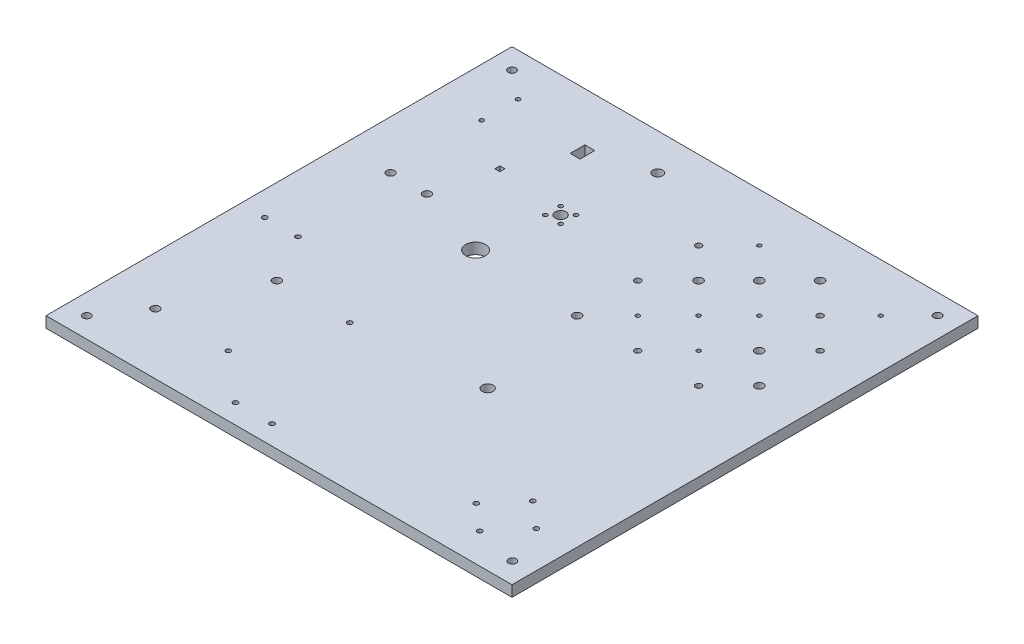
ISO-10303-21;
HEADER;
FILE_DESCRIPTION(('STEP AP214'),'2;1');
FILE_NAME('part.step','',(''),(''),'','','');
FILE_SCHEMA(('AUTOMOTIVE_DESIGN { 1 0 10303 214 1 1 1 1 }'));
ENDSEC;
DATA;
#1=APPLICATION_CONTEXT('core data for automotive mechanical design processes');
#2=APPLICATION_PROTOCOL_DEFINITION('international standard','automotive_design',2000,#1);
#3=PRODUCT_CONTEXT('',#1,'mechanical');
#4=PRODUCT('Part','Part','',(#3));
#5=PRODUCT_RELATED_PRODUCT_CATEGORY('part','',(#4));
#6=PRODUCT_DEFINITION_FORMATION('','',#4);
#7=PRODUCT_DEFINITION_CONTEXT('part definition',#1,'design');
#8=PRODUCT_DEFINITION('design','',#6,#7);
#9=PRODUCT_DEFINITION_SHAPE('','',#8);
#10=(LENGTH_UNIT() NAMED_UNIT(*) SI_UNIT(.MILLI.,.METRE.));
#11=(NAMED_UNIT(*) PLANE_ANGLE_UNIT() SI_UNIT($,.RADIAN.));
#12=(NAMED_UNIT(*) SI_UNIT($,.STERADIAN.) SOLID_ANGLE_UNIT());
#13=UNCERTAINTY_MEASURE_WITH_UNIT(LENGTH_MEASURE(1.E-05),#10,'distance_accuracy_value','');
#14=(GEOMETRIC_REPRESENTATION_CONTEXT(3) GLOBAL_UNCERTAINTY_ASSIGNED_CONTEXT((#13)) GLOBAL_UNIT_ASSIGNED_CONTEXT((#10,
#11,#12)) REPRESENTATION_CONTEXT('',''));
#15=CARTESIAN_POINT('',(0.,0.,0.));
#16=DIRECTION('',(0.,0.,1.));
#17=DIRECTION('',(1.,0.,0.));
#18=AXIS2_PLACEMENT_3D('',#15,#16,#17);
#19=CARTESIAN_POINT('',(191.77,8.9916,191.77));
#20=DIRECTION('',(-1.,0.,0.));
#21=DIRECTION('',(0.,0.,1.));
#22=AXIS2_PLACEMENT_3D('',#19,#20,#21);
#23=PLANE('',#22);
#24=DIRECTION('',(0.,0.,-1.));
#25=VECTOR('',#24,1.);
#26=CARTESIAN_POINT('',(191.77,0.,191.77));
#27=LINE('',#26,#25);
#28=CARTESIAN_POINT('',(191.77,0.,191.77));
#29=VERTEX_POINT('',#28);
#30=CARTESIAN_POINT('',(191.77,0.,-191.77));
#31=VERTEX_POINT('',#30);
#32=EDGE_CURVE('E599',#29,#31,#27,.T.);
#33=ORIENTED_EDGE('',*,*,#32,.T.);
#34=DIRECTION('',(0.,-1.,0.));
#35=VECTOR('',#34,1.);
#36=CARTESIAN_POINT('',(191.77,8.9916,-191.77));
#37=LINE('',#36,#35);
#38=CARTESIAN_POINT('',(191.77,8.9916,-191.77));
#39=VERTEX_POINT('',#38);
#40=EDGE_CURVE('E11',#39,#31,#37,.T.);
#41=ORIENTED_EDGE('',*,*,#40,.F.);
#42=DIRECTION('',(0.,0.,-1.));
#43=VECTOR('',#42,1.);
#44=CARTESIAN_POINT('',(191.77,8.9916,191.77));
#45=LINE('',#44,#43);
#46=CARTESIAN_POINT('',(191.77,8.9916,191.77));
#47=VERTEX_POINT('',#46);
#48=EDGE_CURVE('E600',#47,#39,#45,.T.);
#49=ORIENTED_EDGE('',*,*,#48,.F.);
#50=DIRECTION('',(0.,-1.,0.));
#51=VECTOR('',#50,1.);
#52=CARTESIAN_POINT('',(191.77,8.9916,191.77));
#53=LINE('',#52,#51);
#54=EDGE_CURVE('E614',#47,#29,#53,.T.);
#55=ORIENTED_EDGE('',*,*,#54,.T.);
#56=EDGE_LOOP('',(#33,#41,#49,#55));
#57=FACE_BOUND('',#56,.T.);
#58=ADVANCED_FACE('F39',(#57),#23,.F.);
#59=CARTESIAN_POINT('',(-191.77,8.9916,-191.77));
#60=DIRECTION('',(0.,0.,1.));
#61=DIRECTION('',(1.,0.,0.));
#62=AXIS2_PLACEMENT_3D('',#59,#60,#61);
#63=PLANE('',#62);
#64=DIRECTION('',(-1.,0.,0.));
#65=VECTOR('',#64,1.);
#66=CARTESIAN_POINT('',(-191.77,0.,-191.77));
#67=LINE('',#66,#65);
#68=CARTESIAN_POINT('',(-191.77,0.,-191.77));
#69=VERTEX_POINT('',#68);
#70=EDGE_CURVE('E618',#31,#69,#67,.T.);
#71=ORIENTED_EDGE('',*,*,#70,.T.);
#72=DIRECTION('',(0.,-1.,0.));
#73=VECTOR('',#72,1.);
#74=CARTESIAN_POINT('',(-191.77,8.9916,-191.77));
#75=LINE('',#74,#73);
#76=CARTESIAN_POINT('',(-191.77,8.9916,-191.77));
#77=VERTEX_POINT('',#76);
#78=EDGE_CURVE('E48',#77,#69,#75,.T.);
#79=ORIENTED_EDGE('',*,*,#78,.F.);
#80=DIRECTION('',(-1.,0.,0.));
#81=VECTOR('',#80,1.);
#82=CARTESIAN_POINT('',(-191.77,8.9916,-191.77));
#83=LINE('',#82,#81);
#84=EDGE_CURVE('E604',#39,#77,#83,.T.);
#85=ORIENTED_EDGE('',*,*,#84,.F.);
#86=ORIENTED_EDGE('',*,*,#40,.T.);
#87=EDGE_LOOP('',(#71,#79,#85,#86));
#88=FACE_BOUND('',#87,.T.);
#89=ADVANCED_FACE('F803',(#88),#63,.F.);
#90=CARTESIAN_POINT('',(-191.77,8.9916,191.77));
#91=DIRECTION('',(1.,0.,0.));
#92=DIRECTION('',(0.,0.,-1.));
#93=AXIS2_PLACEMENT_3D('',#90,#91,#92);
#94=PLANE('',#93);
#95=DIRECTION('',(0.,0.,1.));
#96=VECTOR('',#95,1.);
#97=CARTESIAN_POINT('',(-191.77,0.,191.77));
#98=LINE('',#97,#96);
#99=CARTESIAN_POINT('',(-191.77,0.,191.77));
#100=VERTEX_POINT('',#99);
#101=EDGE_CURVE('E621',#69,#100,#98,.T.);
#102=ORIENTED_EDGE('',*,*,#101,.T.);
#103=DIRECTION('',(0.,-1.,0.));
#104=VECTOR('',#103,1.);
#105=CARTESIAN_POINT('',(-191.77,8.9916,191.77));
#106=LINE('',#105,#104);
#107=CARTESIAN_POINT('',(-191.77,8.9916,191.77));
#108=VERTEX_POINT('',#107);
#109=EDGE_CURVE('E629',#108,#100,#106,.T.);
#110=ORIENTED_EDGE('',*,*,#109,.F.);
#111=DIRECTION('',(0.,0.,1.));
#112=VECTOR('',#111,1.);
#113=CARTESIAN_POINT('',(-191.77,8.9916,191.77));
#114=LINE('',#113,#112);
#115=EDGE_CURVE('E608',#77,#108,#114,.T.);
#116=ORIENTED_EDGE('',*,*,#115,.F.);
#117=ORIENTED_EDGE('',*,*,#78,.T.);
#118=EDGE_LOOP('',(#102,#110,#116,#117));
#119=FACE_BOUND('',#118,.T.);
#120=ADVANCED_FACE('F800',(#119),#94,.F.);
#121=CARTESIAN_POINT('',(-191.77,8.9916,191.77));
#122=DIRECTION('',(0.,0.,-1.));
#123=DIRECTION('',(-1.,0.,0.));
#124=AXIS2_PLACEMENT_3D('',#121,#122,#123);
#125=PLANE('',#124);
#126=DIRECTION('',(1.,0.,0.));
#127=VECTOR('',#126,1.);
#128=CARTESIAN_POINT('',(-191.77,0.,191.77));
#129=LINE('',#128,#127);
#130=EDGE_CURVE('E605',#100,#29,#129,.T.);
#131=ORIENTED_EDGE('',*,*,#130,.T.);
#132=ORIENTED_EDGE('',*,*,#54,.F.);
#133=DIRECTION('',(1.,0.,0.));
#134=VECTOR('',#133,1.);
#135=CARTESIAN_POINT('',(-191.77,8.9916,191.77));
#136=LINE('',#135,#134);
#137=EDGE_CURVE('E611',#108,#47,#136,.T.);
#138=ORIENTED_EDGE('',*,*,#137,.F.);
#139=ORIENTED_EDGE('',*,*,#109,.T.);
#140=EDGE_LOOP('',(#131,#132,#138,#139));
#141=FACE_BOUND('',#140,.T.);
#142=ADVANCED_FACE('F796',(#141),#125,.F.);
#143=CARTESIAN_POINT('',(0.,8.9916,0.));
#144=DIRECTION('',(0.,-1.,0.));
#145=DIRECTION('',(0.,0.,-1.));
#146=AXIS2_PLACEMENT_3D('',#143,#144,#145);
#147=PLANE('',#146);
#148=CARTESIAN_POINT('',(-61.77,8.9916,-31.77));
#149=DIRECTION('',(0.,1.,0.));
#150=DIRECTION('',(0.,0.,1.));
#151=AXIS2_PLACEMENT_3D('',#148,#149,#150);
#152=CIRCLE('',#151,8.1);
#153=CARTESIAN_POINT('',(-61.77,8.9916,-23.67));
#154=VERTEX_POINT('',#153);
#155=EDGE_CURVE('E1588',#154,#154,#152,.T.);
#156=ORIENTED_EDGE('',*,*,#155,.F.);
#157=EDGE_LOOP('',(#156));
#158=FACE_BOUND('',#157,.T.);
#159=CARTESIAN_POINT('',(-41.77,8.9916,-161.77));
#160=DIRECTION('',(0.,1.,0.));
#161=DIRECTION('',(0.,0.,1.));
#162=AXIS2_PLACEMENT_3D('',#159,#160,#161);
#163=CIRCLE('',#162,4.06);
#164=CARTESIAN_POINT('',(-41.77,8.9916,-157.71));
#165=VERTEX_POINT('',#164);
#166=EDGE_CURVE('E161',#165,#165,#163,.T.);
#167=ORIENTED_EDGE('',*,*,#166,.F.);
#168=EDGE_LOOP('',(#167));
#169=FACE_BOUND('',#168,.T.);
#170=DIRECTION('',(0.,0.,1.));
#171=VECTOR('',#170,1.);
#172=CARTESIAN_POINT('',(-91.77,8.9916,-151.77));
#173=LINE('',#172,#171);
#174=CARTESIAN_POINT('',(-91.77,8.9916,-151.77));
#175=VERTEX_POINT('',#174);
#176=CARTESIAN_POINT('',(-91.77,8.9916,-139.63));
#177=VERTEX_POINT('',#176);
#178=EDGE_CURVE('E170',#175,#177,#173,.T.);
#179=ORIENTED_EDGE('',*,*,#178,.F.);
#180=DIRECTION('',(-1.,0.,0.));
#181=VECTOR('',#180,1.);
#182=CARTESIAN_POINT('',(-83.65,8.9916,-151.77));
#183=LINE('',#182,#181);
#184=CARTESIAN_POINT('',(-83.65,8.9916,-151.77));
#185=VERTEX_POINT('',#184);
#186=EDGE_CURVE('E56',#185,#175,#183,.T.);
#187=ORIENTED_EDGE('',*,*,#186,.F.);
#188=DIRECTION('',(0.,0.,-1.));
#189=VECTOR('',#188,1.);
#190=CARTESIAN_POINT('',(-83.65,8.9916,-139.63));
#191=LINE('',#190,#189);
#192=CARTESIAN_POINT('',(-83.65,8.9916,-139.63));
#193=VERTEX_POINT('',#192);
#194=EDGE_CURVE('E154',#193,#185,#191,.T.);
#195=ORIENTED_EDGE('',*,*,#194,.F.);
#196=DIRECTION('',(1.,0.,0.));
#197=VECTOR('',#196,1.);
#198=CARTESIAN_POINT('',(-91.77,8.9916,-139.63));
#199=LINE('',#198,#197);
#200=EDGE_CURVE('E158',#177,#193,#199,.T.);
#201=ORIENTED_EDGE('',*,*,#200,.F.);
#202=EDGE_LOOP('',(#179,#187,#195,#201));
#203=FACE_BOUND('',#202,.T.);
#204=DIRECTION('',(0.,0.,1.));
#205=VECTOR('',#204,1.);
#206=CARTESIAN_POINT('',(-111.77,8.9916,-101.77));
#207=LINE('',#206,#205);
#208=CARTESIAN_POINT('',(-111.77,8.9916,-101.77));
#209=VERTEX_POINT('',#208);
#210=CARTESIAN_POINT('',(-111.77,8.9916,-97.65));
#211=VERTEX_POINT('',#210);
#212=EDGE_CURVE('E205',#209,#211,#207,.T.);
#213=ORIENTED_EDGE('',*,*,#212,.F.);
#214=DIRECTION('',(-1.,0.,0.));
#215=VECTOR('',#214,1.);
#216=CARTESIAN_POINT('',(-107.65,8.9916,-101.77));
#217=LINE('',#216,#215);
#218=CARTESIAN_POINT('',(-107.65,8.9916,-101.77));
#219=VERTEX_POINT('',#218);
#220=EDGE_CURVE('E64',#219,#209,#217,.T.);
#221=ORIENTED_EDGE('',*,*,#220,.F.);
#222=DIRECTION('',(0.,0.,-1.));
#223=VECTOR('',#222,1.);
#224=CARTESIAN_POINT('',(-107.65,8.9916,-97.65));
#225=LINE('',#224,#223);
#226=CARTESIAN_POINT('',(-107.65,8.9916,-97.65));
#227=VERTEX_POINT('',#226);
#228=EDGE_CURVE('E190',#227,#219,#225,.T.);
#229=ORIENTED_EDGE('',*,*,#228,.F.);
#230=DIRECTION('',(1.,0.,0.));
#231=VECTOR('',#230,1.);
#232=CARTESIAN_POINT('',(-111.77,8.9916,-97.65));
#233=LINE('',#232,#231);
#234=EDGE_CURVE('E210',#211,#227,#233,.T.);
#235=ORIENTED_EDGE('',*,*,#234,.F.);
#236=EDGE_LOOP('',(#213,#221,#229,#235));
#237=FACE_BOUND('',#236,.T.);
#238=CARTESIAN_POINT('',(-51.77,8.9916,-91.77));
#239=DIRECTION('',(0.,1.,0.));
#240=DIRECTION('',(0.,0.,1.));
#241=AXIS2_PLACEMENT_3D('',#238,#239,#240);
#242=CIRCLE('',#241,4.5);
#243=CARTESIAN_POINT('',(-51.77,8.9916,-87.27));
#244=VERTEX_POINT('',#243);
#245=EDGE_CURVE('E230',#244,#244,#242,.T.);
#246=ORIENTED_EDGE('',*,*,#245,.F.);
#247=EDGE_LOOP('',(#246));
#248=FACE_BOUND('',#247,.T.);
#249=CARTESIAN_POINT('',(-151.77,8.9916,-156.77));
#250=DIRECTION('',(0.,1.,0.));
#251=DIRECTION('',(0.,0.,1.));
#252=AXIS2_PLACEMENT_3D('',#249,#250,#251);
#253=CIRCLE('',#252,1.70000000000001);
#254=CARTESIAN_POINT('',(-151.77,8.9916,-155.07));
#255=VERTEX_POINT('',#254);
#256=EDGE_CURVE('E234',#255,#255,#253,.T.);
#257=ORIENTED_EDGE('',*,*,#256,.F.);
#258=EDGE_LOOP('',(#257));
#259=FACE_BOUND('',#258,.T.);
#260=CARTESIAN_POINT('',(-151.77,8.9916,-126.77));
#261=DIRECTION('',(0.,1.,0.));
#262=DIRECTION('',(0.,0.,1.));
#263=AXIS2_PLACEMENT_3D('',#260,#261,#262);
#264=CIRCLE('',#263,1.70000000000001);
#265=CARTESIAN_POINT('',(-151.77,8.9916,-125.07));
#266=VERTEX_POINT('',#265);
#267=EDGE_CURVE('E243',#266,#266,#264,.T.);
#268=ORIENTED_EDGE('',*,*,#267,.F.);
#269=EDGE_LOOP('',(#268));
#270=FACE_BOUND('',#269,.T.);
#271=CARTESIAN_POINT('',(-58.09,8.9916,-85.44));
#272=DIRECTION('',(0.,1.,0.));
#273=DIRECTION('',(0.,0.,1.));
#274=AXIS2_PLACEMENT_3D('',#271,#272,#273);
#275=CIRCLE('',#274,1.7);
#276=CARTESIAN_POINT('',(-58.09,8.9916,-83.74));
#277=VERTEX_POINT('',#276);
#278=EDGE_CURVE('E252',#277,#277,#275,.T.);
#279=ORIENTED_EDGE('',*,*,#278,.F.);
#280=EDGE_LOOP('',(#279));
#281=FACE_BOUND('',#280,.T.);
#282=CARTESIAN_POINT('',(-45.44,8.9916,-85.44));
#283=DIRECTION('',(0.,1.,0.));
#284=DIRECTION('',(0.,0.,1.));
#285=AXIS2_PLACEMENT_3D('',#282,#283,#284);
#286=CIRCLE('',#285,1.7);
#287=CARTESIAN_POINT('',(-45.44,8.9916,-83.74));
#288=VERTEX_POINT('',#287);
#289=EDGE_CURVE('E261',#288,#288,#286,.T.);
#290=ORIENTED_EDGE('',*,*,#289,.F.);
#291=EDGE_LOOP('',(#290));
#292=FACE_BOUND('',#291,.T.);
#293=CARTESIAN_POINT('',(-45.44,8.9916,-98.09));
#294=DIRECTION('',(0.,1.,0.));
#295=DIRECTION('',(0.,0.,1.));
#296=AXIS2_PLACEMENT_3D('',#293,#294,#295);
#297=CIRCLE('',#296,1.7);
#298=CARTESIAN_POINT('',(-45.44,8.9916,-96.39));
#299=VERTEX_POINT('',#298);
#300=EDGE_CURVE('E270',#299,#299,#297,.T.);
#301=ORIENTED_EDGE('',*,*,#300,.F.);
#302=EDGE_LOOP('',(#301));
#303=FACE_BOUND('',#302,.T.);
#304=CARTESIAN_POINT('',(-58.09,8.9916,-98.09));
#305=DIRECTION('',(0.,1.,0.));
#306=DIRECTION('',(0.,0.,1.));
#307=AXIS2_PLACEMENT_3D('',#304,#305,#306);
#308=CIRCLE('',#307,1.7);
#309=CARTESIAN_POINT('',(-58.09,8.9916,-96.39));
#310=VERTEX_POINT('',#309);
#311=EDGE_CURVE('E279',#310,#310,#308,.T.);
#312=ORIENTED_EDGE('',*,*,#311,.F.);
#313=EDGE_LOOP('',(#312));
#314=FACE_BOUND('',#313,.T.);
#315=CARTESIAN_POINT('',(41.77,8.9916,61.77));
#316=DIRECTION('',(0.,1.,0.));
#317=DIRECTION('',(0.,0.,1.));
#318=AXIS2_PLACEMENT_3D('',#315,#316,#317);
#319=CIRCLE('',#318,4.5);
#320=CARTESIAN_POINT('',(41.77,8.9916,66.27));
#321=VERTEX_POINT('',#320);
#322=EDGE_CURVE('E288',#321,#321,#319,.T.);
#323=ORIENTED_EDGE('',*,*,#322,.F.);
#324=EDGE_LOOP('',(#323));
#325=FACE_BOUND('',#324,.T.);
#326=CARTESIAN_POINT('',(-151.77,8.9916,141.77));
#327=DIRECTION('',(0.,1.,0.));
#328=DIRECTION('',(0.,0.,1.));
#329=AXIS2_PLACEMENT_3D('',#326,#327,#328);
#330=CIRCLE('',#329,3.3);
#331=CARTESIAN_POINT('',(-151.77,8.9916,145.07));
#332=VERTEX_POINT('',#331);
#333=EDGE_CURVE('E297',#332,#332,#330,.T.);
#334=ORIENTED_EDGE('',*,*,#333,.F.);
#335=EDGE_LOOP('',(#334));
#336=FACE_BOUND('',#335,.T.);
#337=CARTESIAN_POINT('',(-121.77,8.9916,71.77));
#338=DIRECTION('',(0.,1.,0.));
#339=DIRECTION('',(0.,0.,1.));
#340=AXIS2_PLACEMENT_3D('',#337,#338,#339);
#341=CIRCLE('',#340,3.3);
#342=CARTESIAN_POINT('',(-121.77,8.9916,75.07));
#343=VERTEX_POINT('',#342);
#344=EDGE_CURVE('E306',#343,#343,#341,.T.);
#345=ORIENTED_EDGE('',*,*,#344,.F.);
#346=EDGE_LOOP('',(#345));
#347=FACE_BOUND('',#346,.T.);
#348=CARTESIAN_POINT('',(-151.77,8.9916,-51.77));
#349=DIRECTION('',(0.,1.,0.));
#350=DIRECTION('',(0.,0.,1.));
#351=AXIS2_PLACEMENT_3D('',#348,#349,#350);
#352=CIRCLE('',#351,3.3);
#353=CARTESIAN_POINT('',(-151.77,8.9916,-48.47));
#354=VERTEX_POINT('',#353);
#355=EDGE_CURVE('E315',#354,#354,#352,.T.);
#356=ORIENTED_EDGE('',*,*,#355,.F.);
#357=EDGE_LOOP('',(#356));
#358=FACE_BOUND('',#357,.T.);
#359=CARTESIAN_POINT('',(-121.77,8.9916,-51.77));
#360=DIRECTION('',(0.,1.,0.));
#361=DIRECTION('',(0.,0.,1.));
#362=AXIS2_PLACEMENT_3D('',#359,#360,#361);
#363=CIRCLE('',#362,3.3);
#364=CARTESIAN_POINT('',(-121.77,8.9916,-48.47));
#365=VERTEX_POINT('',#364);
#366=EDGE_CURVE('E324',#365,#365,#363,.T.);
#367=ORIENTED_EDGE('',*,*,#366,.F.);
#368=EDGE_LOOP('',(#367));
#369=FACE_BOUND('',#368,.T.);
#370=CARTESIAN_POINT('',(-51.77,8.9916,175.77));
#371=DIRECTION('',(0.,1.,0.));
#372=DIRECTION('',(0.,0.,1.));
#373=AXIS2_PLACEMENT_3D('',#370,#371,#372);
#374=CIRCLE('',#373,1.99999999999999);
#375=CARTESIAN_POINT('',(-51.77,8.9916,177.77));
#376=VERTEX_POINT('',#375);
#377=EDGE_CURVE('E333',#376,#376,#374,.T.);
#378=ORIENTED_EDGE('',*,*,#377,.F.);
#379=EDGE_LOOP('',(#378));
#380=FACE_BOUND('',#379,.T.);
#381=CARTESIAN_POINT('',(-21.77,8.9916,175.77));
#382=DIRECTION('',(0.,1.,0.));
#383=DIRECTION('',(0.,0.,1.));
#384=AXIS2_PLACEMENT_3D('',#381,#382,#383);
#385=CIRCLE('',#384,1.99999999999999);
#386=CARTESIAN_POINT('',(-21.77,8.9916,177.77));
#387=VERTEX_POINT('',#386);
#388=EDGE_CURVE('E342',#387,#387,#385,.T.);
#389=ORIENTED_EDGE('',*,*,#388,.F.);
#390=EDGE_LOOP('',(#389));
#391=FACE_BOUND('',#390,.T.);
#392=CARTESIAN_POINT('',(-91.77,8.9916,141.77));
#393=DIRECTION('',(0.,1.,0.));
#394=DIRECTION('',(0.,0.,1.));
#395=AXIS2_PLACEMENT_3D('',#392,#393,#394);
#396=CIRCLE('',#395,1.99999999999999);
#397=CARTESIAN_POINT('',(-91.77,8.9916,143.77));
#398=VERTEX_POINT('',#397);
#399=EDGE_CURVE('E351',#398,#398,#396,.T.);
#400=ORIENTED_EDGE('',*,*,#399,.F.);
#401=EDGE_LOOP('',(#400));
#402=FACE_BOUND('',#401,.T.);
#403=CARTESIAN_POINT('',(-61.77,8.9916,71.77));
#404=DIRECTION('',(0.,1.,0.));
#405=DIRECTION('',(0.,0.,1.));
#406=AXIS2_PLACEMENT_3D('',#403,#404,#405);
#407=CIRCLE('',#406,1.99999999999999);
#408=CARTESIAN_POINT('',(-61.77,8.9916,73.77));
#409=VERTEX_POINT('',#408);
#410=EDGE_CURVE('E360',#409,#409,#407,.T.);
#411=ORIENTED_EDGE('',*,*,#410,.F.);
#412=EDGE_LOOP('',(#411));
#413=FACE_BOUND('',#412,.T.);
#414=CARTESIAN_POINT('',(-171.77,8.9916,31.77));
#415=DIRECTION('',(0.,1.,0.));
#416=DIRECTION('',(0.,0.,1.));
#417=AXIS2_PLACEMENT_3D('',#414,#415,#416);
#418=CIRCLE('',#417,2.);
#419=CARTESIAN_POINT('',(-171.77,8.9916,33.77));
#420=VERTEX_POINT('',#419);
#421=EDGE_CURVE('E369',#420,#420,#418,.T.);
#422=ORIENTED_EDGE('',*,*,#421,.F.);
#423=EDGE_LOOP('',(#422));
#424=FACE_BOUND('',#423,.T.);
#425=CARTESIAN_POINT('',(-144.338,8.9916,31.77));
#426=DIRECTION('',(0.,1.,0.));
#427=DIRECTION('',(0.,0.,1.));
#428=AXIS2_PLACEMENT_3D('',#425,#426,#427);
#429=CIRCLE('',#428,2.);
#430=CARTESIAN_POINT('',(-144.338,8.9916,33.77));
#431=VERTEX_POINT('',#430);
#432=EDGE_CURVE('E378',#431,#431,#429,.T.);
#433=ORIENTED_EDGE('',*,*,#432,.F.);
#434=EDGE_LOOP('',(#433));
#435=FACE_BOUND('',#434,.T.);
#436=CARTESIAN_POINT('',(140.229340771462,8.9916,166.77));
#437=DIRECTION('',(0.,1.,0.));
#438=DIRECTION('',(0.,0.,1.));
#439=AXIS2_PLACEMENT_3D('',#436,#437,#438);
#440=CIRCLE('',#439,2.);
#441=CARTESIAN_POINT('',(140.229340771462,8.9916,168.77));
#442=VERTEX_POINT('',#441);
#443=EDGE_CURVE('E387',#442,#442,#440,.T.);
#444=ORIENTED_EDGE('',*,*,#443,.F.);
#445=EDGE_LOOP('',(#444));
#446=FACE_BOUND('',#445,.T.);
#447=CARTESIAN_POINT('',(161.77,8.9916,141.77));
#448=DIRECTION('',(0.,1.,0.));
#449=DIRECTION('',(0.,0.,1.));
#450=AXIS2_PLACEMENT_3D('',#447,#448,#449);
#451=CIRCLE('',#450,2.);
#452=CARTESIAN_POINT('',(161.77,8.9916,143.77));
#453=VERTEX_POINT('',#452);
#454=EDGE_CURVE('E396',#453,#453,#451,.T.);
#455=ORIENTED_EDGE('',*,*,#454,.F.);
#456=EDGE_LOOP('',(#455));
#457=FACE_BOUND('',#456,.T.);
#458=CARTESIAN_POINT('',(140.577784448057,8.9916,123.47));
#459=DIRECTION('',(0.,1.,0.));
#460=DIRECTION('',(0.,0.,1.));
#461=AXIS2_PLACEMENT_3D('',#458,#459,#460);
#462=CIRCLE('',#461,2.);
#463=CARTESIAN_POINT('',(140.577784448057,8.9916,125.47));
#464=VERTEX_POINT('',#463);
#465=EDGE_CURVE('E405',#464,#464,#462,.T.);
#466=ORIENTED_EDGE('',*,*,#465,.F.);
#467=EDGE_LOOP('',(#466));
#468=FACE_BOUND('',#467,.T.);
#469=CARTESIAN_POINT('',(119.037125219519,8.9916,148.47));
#470=DIRECTION('',(0.,1.,0.));
#471=DIRECTION('',(0.,0.,1.));
#472=AXIS2_PLACEMENT_3D('',#469,#470,#471);
#473=CIRCLE('',#472,1.99999999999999);
#474=CARTESIAN_POINT('',(119.037125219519,8.9916,150.47));
#475=VERTEX_POINT('',#474);
#476=EDGE_CURVE('E414',#475,#475,#473,.T.);
#477=ORIENTED_EDGE('',*,*,#476,.F.);
#478=EDGE_LOOP('',(#477));
#479=FACE_BOUND('',#478,.T.);
#480=CARTESIAN_POINT('',(-175.,8.9916,175.));
#481=DIRECTION('',(0.,1.,0.));
#482=DIRECTION('',(0.,0.,1.));
#483=AXIS2_PLACEMENT_3D('',#480,#481,#482);
#484=CIRCLE('',#483,3.17500000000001);
#485=CARTESIAN_POINT('',(-175.,8.9916,178.175));
#486=VERTEX_POINT('',#485);
#487=EDGE_CURVE('E423',#486,#486,#484,.T.);
#488=ORIENTED_EDGE('',*,*,#487,.F.);
#489=EDGE_LOOP('',(#488));
#490=FACE_BOUND('',#489,.T.);
#491=CARTESIAN_POINT('',(-175.,8.9916,-175.));
#492=DIRECTION('',(0.,1.,0.));
#493=DIRECTION('',(0.,0.,1.));
#494=AXIS2_PLACEMENT_3D('',#491,#492,#493);
#495=CIRCLE('',#494,3.17500000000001);
#496=CARTESIAN_POINT('',(-175.,8.9916,-171.825));
#497=VERTEX_POINT('',#496);
#498=EDGE_CURVE('E431',#497,#497,#495,.T.);
#499=ORIENTED_EDGE('',*,*,#498,.F.);
#500=EDGE_LOOP('',(#499));
#501=FACE_BOUND('',#500,.T.);
#502=CARTESIAN_POINT('',(175.,8.9916,-175.23));
#503=DIRECTION('',(0.,1.,0.));
#504=DIRECTION('',(0.,0.,1.));
#505=AXIS2_PLACEMENT_3D('',#502,#503,#504);
#506=CIRCLE('',#505,3.17500000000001);
#507=CARTESIAN_POINT('',(175.,8.9916,-172.055));
#508=VERTEX_POINT('',#507);
#509=EDGE_CURVE('E439',#508,#508,#506,.T.);
#510=ORIENTED_EDGE('',*,*,#509,.F.);
#511=EDGE_LOOP('',(#510));
#512=FACE_BOUND('',#511,.T.);
#513=CARTESIAN_POINT('',(175.,8.9916,174.77));
#514=DIRECTION('',(0.,1.,0.));
#515=DIRECTION('',(0.,0.,1.));
#516=AXIS2_PLACEMENT_3D('',#513,#514,#515);
#517=CIRCLE('',#516,3.17500000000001);
#518=CARTESIAN_POINT('',(175.,8.9916,177.945));
#519=VERTEX_POINT('',#518);
#520=EDGE_CURVE('E447',#519,#519,#517,.T.);
#521=ORIENTED_EDGE('',*,*,#520,.F.);
#522=EDGE_LOOP('',(#521));
#523=FACE_BOUND('',#522,.T.);
#524=CARTESIAN_POINT('',(151.77,8.9916,-51.77));
#525=DIRECTION('',(0.,1.,0.));
#526=DIRECTION('',(0.,0.,1.));
#527=AXIS2_PLACEMENT_3D('',#524,#525,#526);
#528=CIRCLE('',#527,3.39999999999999);
#529=CARTESIAN_POINT('',(151.77,8.9916,-48.37));
#530=VERTEX_POINT('',#529);
#531=EDGE_CURVE('E455',#530,#530,#528,.T.);
#532=ORIENTED_EDGE('',*,*,#531,.F.);
#533=EDGE_LOOP('',(#532));
#534=FACE_BOUND('',#533,.T.);
#535=CARTESIAN_POINT('',(126.77,8.9916,-76.77));
#536=DIRECTION('',(0.,1.,0.));
#537=DIRECTION('',(0.,0.,1.));
#538=AXIS2_PLACEMENT_3D('',#535,#536,#537);
#539=CIRCLE('',#538,3.39999999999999);
#540=CARTESIAN_POINT('',(126.77,8.9916,-73.37));
#541=VERTEX_POINT('',#540);
#542=EDGE_CURVE('E463',#541,#541,#539,.T.);
#543=ORIENTED_EDGE('',*,*,#542,.F.);
#544=EDGE_LOOP('',(#543));
#545=FACE_BOUND('',#544,.T.);
#546=CARTESIAN_POINT('',(76.77,8.9916,-126.77));
#547=DIRECTION('',(0.,1.,0.));
#548=DIRECTION('',(0.,0.,1.));
#549=AXIS2_PLACEMENT_3D('',#546,#547,#548);
#550=CIRCLE('',#549,3.4);
#551=CARTESIAN_POINT('',(76.77,8.9916,-123.37));
#552=VERTEX_POINT('',#551);
#553=EDGE_CURVE('E471',#552,#552,#550,.T.);
#554=ORIENTED_EDGE('',*,*,#553,.F.);
#555=EDGE_LOOP('',(#554));
#556=FACE_BOUND('',#555,.T.);
#557=CARTESIAN_POINT('',(101.77,8.9916,-151.77));
#558=DIRECTION('',(0.,1.,0.));
#559=DIRECTION('',(0.,0.,1.));
#560=AXIS2_PLACEMENT_3D('',#557,#558,#559);
#561=CIRCLE('',#560,3.4);
#562=CARTESIAN_POINT('',(101.77,8.9916,-148.37));
#563=VERTEX_POINT('',#562);
#564=EDGE_CURVE('E479',#563,#563,#561,.T.);
#565=ORIENTED_EDGE('',*,*,#564,.F.);
#566=EDGE_LOOP('',(#565));
#567=FACE_BOUND('',#566,.T.);
#568=CARTESIAN_POINT('',(26.77,8.9916,-26.77));
#569=DIRECTION('',(0.,1.,0.));
#570=DIRECTION('',(0.,0.,1.));
#571=AXIS2_PLACEMENT_3D('',#568,#569,#570);
#572=CIRCLE('',#571,3.4);
#573=CARTESIAN_POINT('',(26.77,8.9916,-23.37));
#574=VERTEX_POINT('',#573);
#575=EDGE_CURVE('E487',#574,#574,#572,.T.);
#576=ORIENTED_EDGE('',*,*,#575,.F.);
#577=EDGE_LOOP('',(#576));
#578=FACE_BOUND('',#577,.T.);
#579=CARTESIAN_POINT('',(51.77,8.9916,-101.77));
#580=DIRECTION('',(0.,1.,0.));
#581=DIRECTION('',(0.,0.,1.));
#582=AXIS2_PLACEMENT_3D('',#579,#580,#581);
#583=CIRCLE('',#582,3.4);
#584=CARTESIAN_POINT('',(51.77,8.9916,-98.37));
#585=VERTEX_POINT('',#584);
#586=EDGE_CURVE('E495',#585,#585,#583,.T.);
#587=ORIENTED_EDGE('',*,*,#586,.F.);
#588=EDGE_LOOP('',(#587));
#589=FACE_BOUND('',#588,.T.);
#590=CARTESIAN_POINT('',(126.77,8.9916,-126.77));
#591=DIRECTION('',(0.,1.,0.));
#592=DIRECTION('',(0.,0.,1.));
#593=AXIS2_PLACEMENT_3D('',#590,#591,#592);
#594=CIRCLE('',#593,2.5);
#595=CARTESIAN_POINT('',(126.77,8.9916,-124.27));
#596=VERTEX_POINT('',#595);
#597=EDGE_CURVE('E503',#596,#596,#594,.T.);
#598=ORIENTED_EDGE('',*,*,#597,.F.);
#599=EDGE_LOOP('',(#598));
#600=FACE_BOUND('',#599,.T.);
#601=CARTESIAN_POINT('',(26.77,8.9916,-126.77));
#602=DIRECTION('',(0.,1.,0.));
#603=DIRECTION('',(0.,0.,1.));
#604=AXIS2_PLACEMENT_3D('',#601,#602,#603);
#605=CIRCLE('',#604,2.5);
#606=CARTESIAN_POINT('',(26.77,8.9916,-124.27));
#607=VERTEX_POINT('',#606);
#608=EDGE_CURVE('E511',#607,#607,#605,.T.);
#609=ORIENTED_EDGE('',*,*,#608,.F.);
#610=EDGE_LOOP('',(#609));
#611=FACE_BOUND('',#610,.T.);
#612=CARTESIAN_POINT('',(151.77,8.9916,-101.77));
#613=DIRECTION('',(0.,1.,0.));
#614=DIRECTION('',(0.,0.,1.));
#615=AXIS2_PLACEMENT_3D('',#612,#613,#614);
#616=CIRCLE('',#615,2.5);
#617=CARTESIAN_POINT('',(151.77,8.9916,-99.27));
#618=VERTEX_POINT('',#617);
#619=EDGE_CURVE('E519',#618,#618,#616,.T.);
#620=ORIENTED_EDGE('',*,*,#619,.F.);
#621=EDGE_LOOP('',(#620));
#622=FACE_BOUND('',#621,.T.);
#623=CARTESIAN_POINT('',(126.77,8.9916,-26.77));
#624=DIRECTION('',(0.,1.,0.));
#625=DIRECTION('',(0.,0.,1.));
#626=AXIS2_PLACEMENT_3D('',#623,#624,#625);
#627=CIRCLE('',#626,2.5);
#628=CARTESIAN_POINT('',(126.77,8.9916,-24.27));
#629=VERTEX_POINT('',#628);
#630=EDGE_CURVE('E527',#629,#629,#627,.T.);
#631=ORIENTED_EDGE('',*,*,#630,.F.);
#632=EDGE_LOOP('',(#631));
#633=FACE_BOUND('',#632,.T.);
#634=CARTESIAN_POINT('',(76.77,8.9916,-26.77));
#635=DIRECTION('',(0.,1.,0.));
#636=DIRECTION('',(0.,0.,1.));
#637=AXIS2_PLACEMENT_3D('',#634,#635,#636);
#638=CIRCLE('',#637,2.5);
#639=CARTESIAN_POINT('',(76.77,8.9916,-24.27));
#640=VERTEX_POINT('',#639);
#641=EDGE_CURVE('E535',#640,#640,#638,.T.);
#642=ORIENTED_EDGE('',*,*,#641,.F.);
#643=EDGE_LOOP('',(#642));
#644=FACE_BOUND('',#643,.T.);
#645=CARTESIAN_POINT('',(26.77,8.9916,-76.77));
#646=DIRECTION('',(0.,1.,0.));
#647=DIRECTION('',(0.,0.,1.));
#648=AXIS2_PLACEMENT_3D('',#645,#646,#647);
#649=CIRCLE('',#648,2.5);
#650=CARTESIAN_POINT('',(26.77,8.9916,-74.27));
#651=VERTEX_POINT('',#650);
#652=EDGE_CURVE('E543',#651,#651,#649,.T.);
#653=ORIENTED_EDGE('',*,*,#652,.F.);
#654=EDGE_LOOP('',(#653));
#655=FACE_BOUND('',#654,.T.);
#656=CARTESIAN_POINT('',(51.77,8.9916,-151.77));
#657=DIRECTION('',(0.,1.,0.));
#658=DIRECTION('',(0.,0.,1.));
#659=AXIS2_PLACEMENT_3D('',#656,#657,#658);
#660=CIRCLE('',#659,1.65);
#661=CARTESIAN_POINT('',(51.77,8.9916,-150.12));
#662=VERTEX_POINT('',#661);
#663=EDGE_CURVE('E551',#662,#662,#660,.T.);
#664=ORIENTED_EDGE('',*,*,#663,.F.);
#665=EDGE_LOOP('',(#664));
#666=FACE_BOUND('',#665,.T.);
#667=CARTESIAN_POINT('',(151.77,8.9916,-151.77));
#668=DIRECTION('',(0.,1.,0.));
#669=DIRECTION('',(0.,0.,1.));
#670=AXIS2_PLACEMENT_3D('',#667,#668,#669);
#671=CIRCLE('',#670,1.64999999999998);
#672=CARTESIAN_POINT('',(151.77,8.9916,-150.12));
#673=VERTEX_POINT('',#672);
#674=EDGE_CURVE('E559',#673,#673,#671,.T.);
#675=ORIENTED_EDGE('',*,*,#674,.F.);
#676=EDGE_LOOP('',(#675));
#677=FACE_BOUND('',#676,.T.);
#678=CARTESIAN_POINT('',(101.77,8.9916,-101.77));
#679=DIRECTION('',(0.,1.,0.));
#680=DIRECTION('',(0.,0.,1.));
#681=AXIS2_PLACEMENT_3D('',#678,#679,#680);
#682=CIRCLE('',#681,1.65);
#683=CARTESIAN_POINT('',(101.77,8.9916,-100.12));
#684=VERTEX_POINT('',#683);
#685=EDGE_CURVE('E567',#684,#684,#682,.T.);
#686=ORIENTED_EDGE('',*,*,#685,.F.);
#687=EDGE_LOOP('',(#686));
#688=FACE_BOUND('',#687,.T.);
#689=CARTESIAN_POINT('',(51.77,8.9916,-51.77));
#690=DIRECTION('',(0.,1.,0.));
#691=DIRECTION('',(0.,0.,1.));
#692=AXIS2_PLACEMENT_3D('',#689,#690,#691);
#693=CIRCLE('',#692,1.65);
#694=CARTESIAN_POINT('',(51.77,8.9916,-50.12));
#695=VERTEX_POINT('',#694);
#696=EDGE_CURVE('E575',#695,#695,#693,.T.);
#697=ORIENTED_EDGE('',*,*,#696,.F.);
#698=EDGE_LOOP('',(#697));
#699=FACE_BOUND('',#698,.T.);
#700=CARTESIAN_POINT('',(76.77,8.9916,-76.77));
#701=DIRECTION('',(0.,1.,0.));
#702=DIRECTION('',(0.,0.,1.));
#703=AXIS2_PLACEMENT_3D('',#700,#701,#702);
#704=CIRCLE('',#703,1.65);
#705=CARTESIAN_POINT('',(76.77,8.9916,-75.1199999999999));
#706=VERTEX_POINT('',#705);
#707=EDGE_CURVE('E583',#706,#706,#704,.T.);
#708=ORIENTED_EDGE('',*,*,#707,.F.);
#709=EDGE_LOOP('',(#708));
#710=FACE_BOUND('',#709,.T.);
#711=CARTESIAN_POINT('',(101.77,8.9916,-51.77));
#712=DIRECTION('',(0.,1.,0.));
#713=DIRECTION('',(0.,0.,1.));
#714=AXIS2_PLACEMENT_3D('',#711,#712,#713);
#715=CIRCLE('',#714,1.65);
#716=CARTESIAN_POINT('',(101.77,8.9916,-50.12));
#717=VERTEX_POINT('',#716);
#718=EDGE_CURVE('E591',#717,#717,#715,.T.);
#719=ORIENTED_EDGE('',*,*,#718,.F.);
#720=EDGE_LOOP('',(#719));
#721=FACE_BOUND('',#720,.T.);
#722=ORIENTED_EDGE('',*,*,#48,.T.);
#723=ORIENTED_EDGE('',*,*,#84,.T.);
#724=ORIENTED_EDGE('',*,*,#115,.T.);
#725=ORIENTED_EDGE('',*,*,#137,.T.);
#726=EDGE_LOOP('',(#722,#723,#724,#725));
#727=FACE_BOUND('',#726,.T.);
#728=ADVANCED_FACE('F702',(#158,#169,#203,#237,#248,#259,#270,#281,#292,#303,#314,#325,#336,
#347,#358,#369,#380,#391,#402,#413,#424,#435,#446,#457,#468,#479,#490,#501,#512,#523,#534,#545,
#556,#567,#578,#589,#600,#611,#622,#633,#644,#655,#666,#677,#688,#699,#710,#721,#727),#147,.F.);
#729=CARTESIAN_POINT('',(0.,0.,0.));
#730=DIRECTION('',(0.,-1.,0.));
#731=DIRECTION('',(0.,0.,-1.));
#732=AXIS2_PLACEMENT_3D('',#729,#730,#731);
#733=PLANE('',#732);
#734=CARTESIAN_POINT('',(-61.77,0.,-31.77));
#735=DIRECTION('',(0.,1.,0.));
#736=DIRECTION('',(0.,0.,1.));
#737=AXIS2_PLACEMENT_3D('',#734,#735,#736);
#738=CIRCLE('',#737,8.1);
#739=CARTESIAN_POINT('',(-61.77,0.,-23.67));
#740=VERTEX_POINT('',#739);
#741=EDGE_CURVE('E239',#740,#740,#738,.T.);
#742=ORIENTED_EDGE('',*,*,#741,.T.);
#743=EDGE_LOOP('',(#742));
#744=FACE_BOUND('',#743,.T.);
#745=CARTESIAN_POINT('',(-41.77,0.,-161.77));
#746=DIRECTION('',(0.,1.,0.));
#747=DIRECTION('',(0.,0.,1.));
#748=AXIS2_PLACEMENT_3D('',#745,#746,#747);
#749=CIRCLE('',#748,4.06);
#750=CARTESIAN_POINT('',(-41.77,0.,-157.71));
#751=VERTEX_POINT('',#750);
#752=EDGE_CURVE('E1590',#751,#751,#749,.T.);
#753=ORIENTED_EDGE('',*,*,#752,.T.);
#754=EDGE_LOOP('',(#753));
#755=FACE_BOUND('',#754,.T.);
#756=DIRECTION('',(-1.,0.,0.));
#757=VECTOR('',#756,1.);
#758=CARTESIAN_POINT('',(-83.65,0.,-151.77));
#759=LINE('',#758,#757);
#760=CARTESIAN_POINT('',(-83.65,0.,-151.77));
#761=VERTEX_POINT('',#760);
#762=CARTESIAN_POINT('',(-91.77,0.,-151.77));
#763=VERTEX_POINT('',#762);
#764=EDGE_CURVE('E132',#761,#763,#759,.T.);
#765=ORIENTED_EDGE('',*,*,#764,.T.);
#766=DIRECTION('',(0.,0.,1.));
#767=VECTOR('',#766,1.);
#768=CARTESIAN_POINT('',(-91.77,0.,-151.77));
#769=LINE('',#768,#767);
#770=CARTESIAN_POINT('',(-91.77,0.,-139.63));
#771=VERTEX_POINT('',#770);
#772=EDGE_CURVE('E143',#763,#771,#769,.T.);
#773=ORIENTED_EDGE('',*,*,#772,.T.);
#774=DIRECTION('',(1.,0.,0.));
#775=VECTOR('',#774,1.);
#776=CARTESIAN_POINT('',(-91.77,0.,-139.63));
#777=LINE('',#776,#775);
#778=CARTESIAN_POINT('',(-83.65,0.,-139.63));
#779=VERTEX_POINT('',#778);
#780=EDGE_CURVE('E148',#771,#779,#777,.T.);
#781=ORIENTED_EDGE('',*,*,#780,.T.);
#782=DIRECTION('',(0.,0.,-1.));
#783=VECTOR('',#782,1.);
#784=CARTESIAN_POINT('',(-83.65,0.,-139.63));
#785=LINE('',#784,#783);
#786=EDGE_CURVE('E139',#779,#761,#785,.T.);
#787=ORIENTED_EDGE('',*,*,#786,.T.);
#788=EDGE_LOOP('',(#765,#773,#781,#787));
#789=FACE_BOUND('',#788,.T.);
#790=DIRECTION('',(-1.,0.,0.));
#791=VECTOR('',#790,1.);
#792=CARTESIAN_POINT('',(-107.65,0.,-101.77));
#793=LINE('',#792,#791);
#794=CARTESIAN_POINT('',(-107.65,0.,-101.77));
#795=VERTEX_POINT('',#794);
#796=CARTESIAN_POINT('',(-111.77,0.,-101.77));
#797=VERTEX_POINT('',#796);
#798=EDGE_CURVE('E185',#795,#797,#793,.T.);
#799=ORIENTED_EDGE('',*,*,#798,.T.);
#800=DIRECTION('',(0.,0.,1.));
#801=VECTOR('',#800,1.);
#802=CARTESIAN_POINT('',(-111.77,0.,-101.77));
#803=LINE('',#802,#801);
#804=CARTESIAN_POINT('',(-111.77,0.,-97.65));
#805=VERTEX_POINT('',#804);
#806=EDGE_CURVE('E189',#797,#805,#803,.T.);
#807=ORIENTED_EDGE('',*,*,#806,.T.);
#808=DIRECTION('',(1.,0.,0.));
#809=VECTOR('',#808,1.);
#810=CARTESIAN_POINT('',(-111.77,0.,-97.65));
#811=LINE('',#810,#809);
#812=CARTESIAN_POINT('',(-107.65,0.,-97.65));
#813=VERTEX_POINT('',#812);
#814=EDGE_CURVE('E194',#805,#813,#811,.T.);
#815=ORIENTED_EDGE('',*,*,#814,.T.);
#816=DIRECTION('',(0.,0.,-1.));
#817=VECTOR('',#816,1.);
#818=CARTESIAN_POINT('',(-107.65,0.,-97.65));
#819=LINE('',#818,#817);
#820=EDGE_CURVE('E198',#813,#795,#819,.T.);
#821=ORIENTED_EDGE('',*,*,#820,.T.);
#822=EDGE_LOOP('',(#799,#807,#815,#821));
#823=FACE_BOUND('',#822,.T.);
#824=CARTESIAN_POINT('',(-51.77,0.,-91.77));
#825=DIRECTION('',(0.,1.,0.));
#826=DIRECTION('',(0.,0.,1.));
#827=AXIS2_PLACEMENT_3D('',#824,#825,#826);
#828=CIRCLE('',#827,4.5);
#829=CARTESIAN_POINT('',(-51.77,0.,-87.27));
#830=VERTEX_POINT('',#829);
#831=EDGE_CURVE('E206',#830,#830,#828,.T.);
#832=ORIENTED_EDGE('',*,*,#831,.T.);
#833=EDGE_LOOP('',(#832));
#834=FACE_BOUND('',#833,.T.);
#835=CARTESIAN_POINT('',(-151.77,0.,-156.77));
#836=DIRECTION('',(0.,-1.,0.));
#837=DIRECTION('',(0.,0.,-1.));
#838=AXIS2_PLACEMENT_3D('',#835,#836,#837);
#839=CIRCLE('',#838,1.69733715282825);
#840=CARTESIAN_POINT('',(-151.77,0.,-158.467337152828));
#841=VERTEX_POINT('',#840);
#842=EDGE_CURVE('E42',#841,#841,#839,.T.);
#843=ORIENTED_EDGE('',*,*,#842,.F.);
#844=EDGE_LOOP('',(#843));
#845=FACE_BOUND('',#844,.T.);
#846=CARTESIAN_POINT('',(-151.77,0.,-126.77));
#847=DIRECTION('',(0.,-1.,0.));
#848=DIRECTION('',(0.,0.,-1.));
#849=AXIS2_PLACEMENT_3D('',#846,#847,#848);
#850=CIRCLE('',#849,1.69733715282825);
#851=CARTESIAN_POINT('',(-151.77,0.,-128.467337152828));
#852=VERTEX_POINT('',#851);
#853=EDGE_CURVE('E251',#852,#852,#850,.T.);
#854=ORIENTED_EDGE('',*,*,#853,.F.);
#855=EDGE_LOOP('',(#854));
#856=FACE_BOUND('',#855,.T.);
#857=CARTESIAN_POINT('',(-58.09,0.,-85.44));
#858=DIRECTION('',(0.,-1.,0.));
#859=DIRECTION('',(0.,0.,-1.));
#860=AXIS2_PLACEMENT_3D('',#857,#858,#859);
#861=CIRCLE('',#860,1.69733715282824);
#862=CARTESIAN_POINT('',(-58.09,0.,-87.1373371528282));
#863=VERTEX_POINT('',#862);
#864=EDGE_CURVE('E260',#863,#863,#861,.T.);
#865=ORIENTED_EDGE('',*,*,#864,.F.);
#866=EDGE_LOOP('',(#865));
#867=FACE_BOUND('',#866,.T.);
#868=CARTESIAN_POINT('',(-45.44,0.,-85.44));
#869=DIRECTION('',(0.,-1.,0.));
#870=DIRECTION('',(0.,0.,-1.));
#871=AXIS2_PLACEMENT_3D('',#868,#869,#870);
#872=CIRCLE('',#871,1.69733715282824);
#873=CARTESIAN_POINT('',(-45.44,0.,-87.1373371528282));
#874=VERTEX_POINT('',#873);
#875=EDGE_CURVE('E269',#874,#874,#872,.T.);
#876=ORIENTED_EDGE('',*,*,#875,.F.);
#877=EDGE_LOOP('',(#876));
#878=FACE_BOUND('',#877,.T.);
#879=CARTESIAN_POINT('',(-45.44,0.,-98.09));
#880=DIRECTION('',(0.,-1.,0.));
#881=DIRECTION('',(0.,0.,-1.));
#882=AXIS2_PLACEMENT_3D('',#879,#880,#881);
#883=CIRCLE('',#882,1.69733715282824);
#884=CARTESIAN_POINT('',(-45.44,0.,-99.7873371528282));
#885=VERTEX_POINT('',#884);
#886=EDGE_CURVE('E278',#885,#885,#883,.T.);
#887=ORIENTED_EDGE('',*,*,#886,.F.);
#888=EDGE_LOOP('',(#887));
#889=FACE_BOUND('',#888,.T.);
#890=CARTESIAN_POINT('',(-58.09,0.,-98.09));
#891=DIRECTION('',(0.,-1.,0.));
#892=DIRECTION('',(0.,0.,-1.));
#893=AXIS2_PLACEMENT_3D('',#890,#891,#892);
#894=CIRCLE('',#893,1.69733715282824);
#895=CARTESIAN_POINT('',(-58.09,0.,-99.7873371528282));
#896=VERTEX_POINT('',#895);
#897=EDGE_CURVE('E287',#896,#896,#894,.T.);
#898=ORIENTED_EDGE('',*,*,#897,.F.);
#899=EDGE_LOOP('',(#898));
#900=FACE_BOUND('',#899,.T.);
#901=CARTESIAN_POINT('',(41.77,0.,61.77));
#902=DIRECTION('',(0.,-1.,0.));
#903=DIRECTION('',(0.,0.,-1.));
#904=AXIS2_PLACEMENT_3D('',#901,#902,#903);
#905=CIRCLE('',#904,4.49733715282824);
#906=CARTESIAN_POINT('',(41.77,0.,57.2726628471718));
#907=VERTEX_POINT('',#906);
#908=EDGE_CURVE('E296',#907,#907,#905,.T.);
#909=ORIENTED_EDGE('',*,*,#908,.F.);
#910=EDGE_LOOP('',(#909));
#911=FACE_BOUND('',#910,.T.);
#912=CARTESIAN_POINT('',(-151.77,0.,141.77));
#913=DIRECTION('',(0.,-1.,0.));
#914=DIRECTION('',(0.,0.,-1.));
#915=AXIS2_PLACEMENT_3D('',#912,#913,#914);
#916=CIRCLE('',#915,3.29733715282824);
#917=CARTESIAN_POINT('',(-151.77,0.,138.472662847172));
#918=VERTEX_POINT('',#917);
#919=EDGE_CURVE('E305',#918,#918,#916,.T.);
#920=ORIENTED_EDGE('',*,*,#919,.F.);
#921=EDGE_LOOP('',(#920));
#922=FACE_BOUND('',#921,.T.);
#923=CARTESIAN_POINT('',(-121.77,0.,71.77));
#924=DIRECTION('',(0.,-1.,0.));
#925=DIRECTION('',(0.,0.,-1.));
#926=AXIS2_PLACEMENT_3D('',#923,#924,#925);
#927=CIRCLE('',#926,3.29733715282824);
#928=CARTESIAN_POINT('',(-121.77,0.,68.4726628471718));
#929=VERTEX_POINT('',#928);
#930=EDGE_CURVE('E314',#929,#929,#927,.T.);
#931=ORIENTED_EDGE('',*,*,#930,.F.);
#932=EDGE_LOOP('',(#931));
#933=FACE_BOUND('',#932,.T.);
#934=CARTESIAN_POINT('',(-151.77,0.,-51.77));
#935=DIRECTION('',(0.,-1.,0.));
#936=DIRECTION('',(0.,0.,-1.));
#937=AXIS2_PLACEMENT_3D('',#934,#935,#936);
#938=CIRCLE('',#937,3.29733715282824);
#939=CARTESIAN_POINT('',(-151.77,0.,-55.0673371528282));
#940=VERTEX_POINT('',#939);
#941=EDGE_CURVE('E323',#940,#940,#938,.T.);
#942=ORIENTED_EDGE('',*,*,#941,.F.);
#943=EDGE_LOOP('',(#942));
#944=FACE_BOUND('',#943,.T.);
#945=CARTESIAN_POINT('',(-121.77,0.,-51.77));
#946=DIRECTION('',(0.,-1.,0.));
#947=DIRECTION('',(0.,0.,-1.));
#948=AXIS2_PLACEMENT_3D('',#945,#946,#947);
#949=CIRCLE('',#948,3.29733715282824);
#950=CARTESIAN_POINT('',(-121.77,0.,-55.0673371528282));
#951=VERTEX_POINT('',#950);
#952=EDGE_CURVE('E332',#951,#951,#949,.T.);
#953=ORIENTED_EDGE('',*,*,#952,.F.);
#954=EDGE_LOOP('',(#953));
#955=FACE_BOUND('',#954,.T.);
#956=CARTESIAN_POINT('',(-51.77,0.,175.77));
#957=DIRECTION('',(0.,-1.,0.));
#958=DIRECTION('',(0.,0.,-1.));
#959=AXIS2_PLACEMENT_3D('',#956,#957,#958);
#960=CIRCLE('',#959,1.99733715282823);
#961=CARTESIAN_POINT('',(-51.77,0.,173.772662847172));
#962=VERTEX_POINT('',#961);
#963=EDGE_CURVE('E341',#962,#962,#960,.T.);
#964=ORIENTED_EDGE('',*,*,#963,.F.);
#965=EDGE_LOOP('',(#964));
#966=FACE_BOUND('',#965,.T.);
#967=CARTESIAN_POINT('',(-21.77,0.,175.77));
#968=DIRECTION('',(0.,-1.,0.));
#969=DIRECTION('',(0.,0.,-1.));
#970=AXIS2_PLACEMENT_3D('',#967,#968,#969);
#971=CIRCLE('',#970,1.99733715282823);
#972=CARTESIAN_POINT('',(-21.77,0.,173.772662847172));
#973=VERTEX_POINT('',#972);
#974=EDGE_CURVE('E350',#973,#973,#971,.T.);
#975=ORIENTED_EDGE('',*,*,#974,.F.);
#976=EDGE_LOOP('',(#975));
#977=FACE_BOUND('',#976,.T.);
#978=CARTESIAN_POINT('',(-91.77,0.,141.77));
#979=DIRECTION('',(0.,-1.,0.));
#980=DIRECTION('',(0.,0.,-1.));
#981=AXIS2_PLACEMENT_3D('',#978,#979,#980);
#982=CIRCLE('',#981,1.99733715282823);
#983=CARTESIAN_POINT('',(-91.77,0.,139.772662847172));
#984=VERTEX_POINT('',#983);
#985=EDGE_CURVE('E359',#984,#984,#982,.T.);
#986=ORIENTED_EDGE('',*,*,#985,.F.);
#987=EDGE_LOOP('',(#986));
#988=FACE_BOUND('',#987,.T.);
#989=CARTESIAN_POINT('',(-61.77,0.,71.77));
#990=DIRECTION('',(0.,-1.,0.));
#991=DIRECTION('',(0.,0.,-1.));
#992=AXIS2_PLACEMENT_3D('',#989,#990,#991);
#993=CIRCLE('',#992,1.99733715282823);
#994=CARTESIAN_POINT('',(-61.77,0.,69.7726628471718));
#995=VERTEX_POINT('',#994);
#996=EDGE_CURVE('E368',#995,#995,#993,.T.);
#997=ORIENTED_EDGE('',*,*,#996,.F.);
#998=EDGE_LOOP('',(#997));
#999=FACE_BOUND('',#998,.T.);
#1000=CARTESIAN_POINT('',(-171.77,0.,31.77));
#1001=DIRECTION('',(0.,-1.,0.));
#1002=DIRECTION('',(0.,0.,-1.));
#1003=AXIS2_PLACEMENT_3D('',#1000,#1001,#1002);
#1004=CIRCLE('',#1003,1.99733715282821);
#1005=CARTESIAN_POINT('',(-171.77,0.,29.7726628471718));
#1006=VERTEX_POINT('',#1005);
#1007=EDGE_CURVE('E377',#1006,#1006,#1004,.T.);
#1008=ORIENTED_EDGE('',*,*,#1007,.F.);
#1009=EDGE_LOOP('',(#1008));
#1010=FACE_BOUND('',#1009,.T.);
#1011=CARTESIAN_POINT('',(-144.338,0.,31.77));
#1012=DIRECTION('',(0.,-1.,0.));
#1013=DIRECTION('',(0.,0.,-1.));
#1014=AXIS2_PLACEMENT_3D('',#1011,#1012,#1013);
#1015=CIRCLE('',#1014,1.99733715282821);
#1016=CARTESIAN_POINT('',(-144.338,0.,29.7726628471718));
#1017=VERTEX_POINT('',#1016);
#1018=EDGE_CURVE('E386',#1017,#1017,#1015,.T.);
#1019=ORIENTED_EDGE('',*,*,#1018,.F.);
#1020=EDGE_LOOP('',(#1019));
#1021=FACE_BOUND('',#1020,.T.);
#1022=CARTESIAN_POINT('',(140.229340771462,0.,166.77));
#1023=DIRECTION('',(0.,-1.,0.));
#1024=DIRECTION('',(0.,0.,-1.));
#1025=AXIS2_PLACEMENT_3D('',#1022,#1023,#1024);
#1026=CIRCLE('',#1025,1.99733715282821);
#1027=CARTESIAN_POINT('',(140.229340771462,0.,164.772662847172));
#1028=VERTEX_POINT('',#1027);
#1029=EDGE_CURVE('E395',#1028,#1028,#1026,.T.);
#1030=ORIENTED_EDGE('',*,*,#1029,.F.);
#1031=EDGE_LOOP('',(#1030));
#1032=FACE_BOUND('',#1031,.T.);
#1033=CARTESIAN_POINT('',(161.77,0.,141.77));
#1034=DIRECTION('',(0.,-1.,0.));
#1035=DIRECTION('',(0.,0.,-1.));
#1036=AXIS2_PLACEMENT_3D('',#1033,#1034,#1035);
#1037=CIRCLE('',#1036,1.99733715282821);
#1038=CARTESIAN_POINT('',(161.77,0.,139.772662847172));
#1039=VERTEX_POINT('',#1038);
#1040=EDGE_CURVE('E404',#1039,#1039,#1037,.T.);
#1041=ORIENTED_EDGE('',*,*,#1040,.F.);
#1042=EDGE_LOOP('',(#1041));
#1043=FACE_BOUND('',#1042,.T.);
#1044=CARTESIAN_POINT('',(140.577784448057,0.,123.47));
#1045=DIRECTION('',(0.,-1.,0.));
#1046=DIRECTION('',(0.,0.,-1.));
#1047=AXIS2_PLACEMENT_3D('',#1044,#1045,#1046);
#1048=CIRCLE('',#1047,1.99733715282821);
#1049=CARTESIAN_POINT('',(140.577784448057,0.,121.472662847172));
#1050=VERTEX_POINT('',#1049);
#1051=EDGE_CURVE('E413',#1050,#1050,#1048,.T.);
#1052=ORIENTED_EDGE('',*,*,#1051,.F.);
#1053=EDGE_LOOP('',(#1052));
#1054=FACE_BOUND('',#1053,.T.);
#1055=CARTESIAN_POINT('',(119.037125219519,0.,148.47));
#1056=DIRECTION('',(0.,-1.,0.));
#1057=DIRECTION('',(0.,0.,-1.));
#1058=AXIS2_PLACEMENT_3D('',#1055,#1056,#1057);
#1059=CIRCLE('',#1058,1.99733715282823);
#1060=CARTESIAN_POINT('',(119.037125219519,0.,146.472662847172));
#1061=VERTEX_POINT('',#1060);
#1062=EDGE_CURVE('E422',#1061,#1061,#1059,.T.);
#1063=ORIENTED_EDGE('',*,*,#1062,.F.);
#1064=EDGE_LOOP('',(#1063));
#1065=FACE_BOUND('',#1064,.T.);
#1066=CARTESIAN_POINT('',(-175.,0.,175.));
#1067=DIRECTION('',(0.,1.,0.));
#1068=DIRECTION('',(0.,0.,1.));
#1069=AXIS2_PLACEMENT_3D('',#1066,#1067,#1068);
#1070=CIRCLE('',#1069,3.17500000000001);
#1071=CARTESIAN_POINT('',(-175.,0.,178.175));
#1072=VERTEX_POINT('',#1071);
#1073=EDGE_CURVE('E427',#1072,#1072,#1070,.T.);
#1074=ORIENTED_EDGE('',*,*,#1073,.T.);
#1075=EDGE_LOOP('',(#1074));
#1076=FACE_BOUND('',#1075,.T.);
#1077=CARTESIAN_POINT('',(-175.,0.,-175.));
#1078=DIRECTION('',(0.,1.,0.));
#1079=DIRECTION('',(0.,0.,1.));
#1080=AXIS2_PLACEMENT_3D('',#1077,#1078,#1079);
#1081=CIRCLE('',#1080,3.17500000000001);
#1082=CARTESIAN_POINT('',(-175.,0.,-171.825));
#1083=VERTEX_POINT('',#1082);
#1084=EDGE_CURVE('E435',#1083,#1083,#1081,.T.);
#1085=ORIENTED_EDGE('',*,*,#1084,.T.);
#1086=EDGE_LOOP('',(#1085));
#1087=FACE_BOUND('',#1086,.T.);
#1088=CARTESIAN_POINT('',(175.,0.,-175.23));
#1089=DIRECTION('',(0.,1.,0.));
#1090=DIRECTION('',(0.,0.,1.));
#1091=AXIS2_PLACEMENT_3D('',#1088,#1089,#1090);
#1092=CIRCLE('',#1091,3.17500000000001);
#1093=CARTESIAN_POINT('',(175.,0.,-172.055));
#1094=VERTEX_POINT('',#1093);
#1095=EDGE_CURVE('E443',#1094,#1094,#1092,.T.);
#1096=ORIENTED_EDGE('',*,*,#1095,.T.);
#1097=EDGE_LOOP('',(#1096));
#1098=FACE_BOUND('',#1097,.T.);
#1099=CARTESIAN_POINT('',(175.,0.,174.77));
#1100=DIRECTION('',(0.,1.,0.));
#1101=DIRECTION('',(0.,0.,1.));
#1102=AXIS2_PLACEMENT_3D('',#1099,#1100,#1101);
#1103=CIRCLE('',#1102,3.17500000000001);
#1104=CARTESIAN_POINT('',(175.,0.,177.945));
#1105=VERTEX_POINT('',#1104);
#1106=EDGE_CURVE('E451',#1105,#1105,#1103,.T.);
#1107=ORIENTED_EDGE('',*,*,#1106,.T.);
#1108=EDGE_LOOP('',(#1107));
#1109=FACE_BOUND('',#1108,.T.);
#1110=CARTESIAN_POINT('',(151.77,0.,-51.77));
#1111=DIRECTION('',(0.,1.,0.));
#1112=DIRECTION('',(0.,0.,1.));
#1113=AXIS2_PLACEMENT_3D('',#1110,#1111,#1112);
#1114=CIRCLE('',#1113,3.39999999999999);
#1115=CARTESIAN_POINT('',(151.77,0.,-48.37));
#1116=VERTEX_POINT('',#1115);
#1117=EDGE_CURVE('E459',#1116,#1116,#1114,.T.);
#1118=ORIENTED_EDGE('',*,*,#1117,.T.);
#1119=EDGE_LOOP('',(#1118));
#1120=FACE_BOUND('',#1119,.T.);
#1121=CARTESIAN_POINT('',(126.77,0.,-76.77));
#1122=DIRECTION('',(0.,1.,0.));
#1123=DIRECTION('',(0.,0.,1.));
#1124=AXIS2_PLACEMENT_3D('',#1121,#1122,#1123);
#1125=CIRCLE('',#1124,3.39999999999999);
#1126=CARTESIAN_POINT('',(126.77,0.,-73.37));
#1127=VERTEX_POINT('',#1126);
#1128=EDGE_CURVE('E467',#1127,#1127,#1125,.T.);
#1129=ORIENTED_EDGE('',*,*,#1128,.T.);
#1130=EDGE_LOOP('',(#1129));
#1131=FACE_BOUND('',#1130,.T.);
#1132=CARTESIAN_POINT('',(76.77,0.,-126.77));
#1133=DIRECTION('',(0.,1.,0.));
#1134=DIRECTION('',(0.,0.,1.));
#1135=AXIS2_PLACEMENT_3D('',#1132,#1133,#1134);
#1136=CIRCLE('',#1135,3.4);
#1137=CARTESIAN_POINT('',(76.77,0.,-123.37));
#1138=VERTEX_POINT('',#1137);
#1139=EDGE_CURVE('E475',#1138,#1138,#1136,.T.);
#1140=ORIENTED_EDGE('',*,*,#1139,.T.);
#1141=EDGE_LOOP('',(#1140));
#1142=FACE_BOUND('',#1141,.T.);
#1143=CARTESIAN_POINT('',(101.77,0.,-151.77));
#1144=DIRECTION('',(0.,1.,0.));
#1145=DIRECTION('',(0.,0.,1.));
#1146=AXIS2_PLACEMENT_3D('',#1143,#1144,#1145);
#1147=CIRCLE('',#1146,3.4);
#1148=CARTESIAN_POINT('',(101.77,0.,-148.37));
#1149=VERTEX_POINT('',#1148);
#1150=EDGE_CURVE('E483',#1149,#1149,#1147,.T.);
#1151=ORIENTED_EDGE('',*,*,#1150,.T.);
#1152=EDGE_LOOP('',(#1151));
#1153=FACE_BOUND('',#1152,.T.);
#1154=CARTESIAN_POINT('',(26.77,0.,-26.77));
#1155=DIRECTION('',(0.,1.,0.));
#1156=DIRECTION('',(0.,0.,1.));
#1157=AXIS2_PLACEMENT_3D('',#1154,#1155,#1156);
#1158=CIRCLE('',#1157,3.4);
#1159=CARTESIAN_POINT('',(26.77,0.,-23.37));
#1160=VERTEX_POINT('',#1159);
#1161=EDGE_CURVE('E491',#1160,#1160,#1158,.T.);
#1162=ORIENTED_EDGE('',*,*,#1161,.T.);
#1163=EDGE_LOOP('',(#1162));
#1164=FACE_BOUND('',#1163,.T.);
#1165=CARTESIAN_POINT('',(51.77,0.,-101.77));
#1166=DIRECTION('',(0.,1.,0.));
#1167=DIRECTION('',(0.,0.,1.));
#1168=AXIS2_PLACEMENT_3D('',#1165,#1166,#1167);
#1169=CIRCLE('',#1168,3.4);
#1170=CARTESIAN_POINT('',(51.77,0.,-98.37));
#1171=VERTEX_POINT('',#1170);
#1172=EDGE_CURVE('E499',#1171,#1171,#1169,.T.);
#1173=ORIENTED_EDGE('',*,*,#1172,.T.);
#1174=EDGE_LOOP('',(#1173));
#1175=FACE_BOUND('',#1174,.T.);
#1176=CARTESIAN_POINT('',(126.77,0.,-126.77));
#1177=DIRECTION('',(0.,1.,0.));
#1178=DIRECTION('',(0.,0.,1.));
#1179=AXIS2_PLACEMENT_3D('',#1176,#1177,#1178);
#1180=CIRCLE('',#1179,2.5);
#1181=CARTESIAN_POINT('',(126.77,0.,-124.27));
#1182=VERTEX_POINT('',#1181);
#1183=EDGE_CURVE('E507',#1182,#1182,#1180,.T.);
#1184=ORIENTED_EDGE('',*,*,#1183,.T.);
#1185=EDGE_LOOP('',(#1184));
#1186=FACE_BOUND('',#1185,.T.);
#1187=CARTESIAN_POINT('',(26.77,0.,-126.77));
#1188=DIRECTION('',(0.,1.,0.));
#1189=DIRECTION('',(0.,0.,1.));
#1190=AXIS2_PLACEMENT_3D('',#1187,#1188,#1189);
#1191=CIRCLE('',#1190,2.5);
#1192=CARTESIAN_POINT('',(26.77,0.,-124.27));
#1193=VERTEX_POINT('',#1192);
#1194=EDGE_CURVE('E515',#1193,#1193,#1191,.T.);
#1195=ORIENTED_EDGE('',*,*,#1194,.T.);
#1196=EDGE_LOOP('',(#1195));
#1197=FACE_BOUND('',#1196,.T.);
#1198=CARTESIAN_POINT('',(151.77,0.,-101.77));
#1199=DIRECTION('',(0.,1.,0.));
#1200=DIRECTION('',(0.,0.,1.));
#1201=AXIS2_PLACEMENT_3D('',#1198,#1199,#1200);
#1202=CIRCLE('',#1201,2.5);
#1203=CARTESIAN_POINT('',(151.77,0.,-99.27));
#1204=VERTEX_POINT('',#1203);
#1205=EDGE_CURVE('E523',#1204,#1204,#1202,.T.);
#1206=ORIENTED_EDGE('',*,*,#1205,.T.);
#1207=EDGE_LOOP('',(#1206));
#1208=FACE_BOUND('',#1207,.T.);
#1209=CARTESIAN_POINT('',(126.77,0.,-26.77));
#1210=DIRECTION('',(0.,1.,0.));
#1211=DIRECTION('',(0.,0.,1.));
#1212=AXIS2_PLACEMENT_3D('',#1209,#1210,#1211);
#1213=CIRCLE('',#1212,2.5);
#1214=CARTESIAN_POINT('',(126.77,0.,-24.27));
#1215=VERTEX_POINT('',#1214);
#1216=EDGE_CURVE('E531',#1215,#1215,#1213,.T.);
#1217=ORIENTED_EDGE('',*,*,#1216,.T.);
#1218=EDGE_LOOP('',(#1217));
#1219=FACE_BOUND('',#1218,.T.);
#1220=CARTESIAN_POINT('',(76.77,0.,-26.77));
#1221=DIRECTION('',(0.,1.,0.));
#1222=DIRECTION('',(0.,0.,1.));
#1223=AXIS2_PLACEMENT_3D('',#1220,#1221,#1222);
#1224=CIRCLE('',#1223,2.5);
#1225=CARTESIAN_POINT('',(76.77,0.,-24.27));
#1226=VERTEX_POINT('',#1225);
#1227=EDGE_CURVE('E539',#1226,#1226,#1224,.T.);
#1228=ORIENTED_EDGE('',*,*,#1227,.T.);
#1229=EDGE_LOOP('',(#1228));
#1230=FACE_BOUND('',#1229,.T.);
#1231=CARTESIAN_POINT('',(26.77,0.,-76.77));
#1232=DIRECTION('',(0.,1.,0.));
#1233=DIRECTION('',(0.,0.,1.));
#1234=AXIS2_PLACEMENT_3D('',#1231,#1232,#1233);
#1235=CIRCLE('',#1234,2.5);
#1236=CARTESIAN_POINT('',(26.77,0.,-74.27));
#1237=VERTEX_POINT('',#1236);
#1238=EDGE_CURVE('E547',#1237,#1237,#1235,.T.);
#1239=ORIENTED_EDGE('',*,*,#1238,.T.);
#1240=EDGE_LOOP('',(#1239));
#1241=FACE_BOUND('',#1240,.T.);
#1242=CARTESIAN_POINT('',(51.77,0.,-151.77));
#1243=DIRECTION('',(0.,1.,0.));
#1244=DIRECTION('',(0.,0.,1.));
#1245=AXIS2_PLACEMENT_3D('',#1242,#1243,#1244);
#1246=CIRCLE('',#1245,1.65);
#1247=CARTESIAN_POINT('',(51.77,0.,-150.12));
#1248=VERTEX_POINT('',#1247);
#1249=EDGE_CURVE('E555',#1248,#1248,#1246,.T.);
#1250=ORIENTED_EDGE('',*,*,#1249,.T.);
#1251=EDGE_LOOP('',(#1250));
#1252=FACE_BOUND('',#1251,.T.);
#1253=CARTESIAN_POINT('',(151.77,0.,-151.77));
#1254=DIRECTION('',(0.,1.,0.));
#1255=DIRECTION('',(0.,0.,1.));
#1256=AXIS2_PLACEMENT_3D('',#1253,#1254,#1255);
#1257=CIRCLE('',#1256,1.64999999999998);
#1258=CARTESIAN_POINT('',(151.77,0.,-150.12));
#1259=VERTEX_POINT('',#1258);
#1260=EDGE_CURVE('E563',#1259,#1259,#1257,.T.);
#1261=ORIENTED_EDGE('',*,*,#1260,.T.);
#1262=EDGE_LOOP('',(#1261));
#1263=FACE_BOUND('',#1262,.T.);
#1264=CARTESIAN_POINT('',(101.77,0.,-101.77));
#1265=DIRECTION('',(0.,1.,0.));
#1266=DIRECTION('',(0.,0.,1.));
#1267=AXIS2_PLACEMENT_3D('',#1264,#1265,#1266);
#1268=CIRCLE('',#1267,1.65);
#1269=CARTESIAN_POINT('',(101.77,0.,-100.12));
#1270=VERTEX_POINT('',#1269);
#1271=EDGE_CURVE('E571',#1270,#1270,#1268,.T.);
#1272=ORIENTED_EDGE('',*,*,#1271,.T.);
#1273=EDGE_LOOP('',(#1272));
#1274=FACE_BOUND('',#1273,.T.);
#1275=CARTESIAN_POINT('',(51.77,0.,-51.77));
#1276=DIRECTION('',(0.,1.,0.));
#1277=DIRECTION('',(0.,0.,1.));
#1278=AXIS2_PLACEMENT_3D('',#1275,#1276,#1277);
#1279=CIRCLE('',#1278,1.65);
#1280=CARTESIAN_POINT('',(51.77,0.,-50.12));
#1281=VERTEX_POINT('',#1280);
#1282=EDGE_CURVE('E579',#1281,#1281,#1279,.T.);
#1283=ORIENTED_EDGE('',*,*,#1282,.T.);
#1284=EDGE_LOOP('',(#1283));
#1285=FACE_BOUND('',#1284,.T.);
#1286=CARTESIAN_POINT('',(76.77,0.,-76.77));
#1287=DIRECTION('',(0.,1.,0.));
#1288=DIRECTION('',(0.,0.,1.));
#1289=AXIS2_PLACEMENT_3D('',#1286,#1287,#1288);
#1290=CIRCLE('',#1289,1.65);
#1291=CARTESIAN_POINT('',(76.77,0.,-75.1199999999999));
#1292=VERTEX_POINT('',#1291);
#1293=EDGE_CURVE('E587',#1292,#1292,#1290,.T.);
#1294=ORIENTED_EDGE('',*,*,#1293,.T.);
#1295=EDGE_LOOP('',(#1294));
#1296=FACE_BOUND('',#1295,.T.);
#1297=CARTESIAN_POINT('',(101.77,0.,-51.77));
#1298=DIRECTION('',(0.,1.,0.));
#1299=DIRECTION('',(0.,0.,1.));
#1300=AXIS2_PLACEMENT_3D('',#1297,#1298,#1299);
#1301=CIRCLE('',#1300,1.65);
#1302=CARTESIAN_POINT('',(101.77,0.,-50.12));
#1303=VERTEX_POINT('',#1302);
#1304=EDGE_CURVE('E595',#1303,#1303,#1301,.T.);
#1305=ORIENTED_EDGE('',*,*,#1304,.T.);
#1306=EDGE_LOOP('',(#1305));
#1307=FACE_BOUND('',#1306,.T.);
#1308=ORIENTED_EDGE('',*,*,#32,.F.);
#1309=ORIENTED_EDGE('',*,*,#130,.F.);
#1310=ORIENTED_EDGE('',*,*,#101,.F.);
#1311=ORIENTED_EDGE('',*,*,#70,.F.);
#1312=EDGE_LOOP('',(#1308,#1309,#1310,#1311));
#1313=FACE_BOUND('',#1312,.T.);
#1314=ADVANCED_FACE('F150',(#744,#755,#789,#823,#834,#845,#856,#867,#878,#889,#900,#911,#922,
#933,#944,#955,#966,#977,#988,#999,#1010,#1021,#1032,#1043,#1054,#1065,#1076,#1087,#1098,#1109,
#1120,#1131,#1142,#1153,#1164,#1175,#1186,#1197,#1208,#1219,#1230,#1241,#1252,#1263,#1274,#1285,
#1296,#1307,#1313),#733,.T.);
#1315=CARTESIAN_POINT('',(101.77,8.9916,-51.77));
#1316=DIRECTION('',(0.,1.,0.));
#1317=DIRECTION('',(0.,0.,1.));
#1318=AXIS2_PLACEMENT_3D('',#1315,#1316,#1317);
#1319=CYLINDRICAL_SURFACE('',#1318,1.65);
#1320=ORIENTED_EDGE('',*,*,#1304,.F.);
#1321=EDGE_LOOP('',(#1320));
#1322=FACE_BOUND('',#1321,.T.);
#1323=ORIENTED_EDGE('',*,*,#718,.T.);
#1324=EDGE_LOOP('',(#1323));
#1325=FACE_BOUND('',#1324,.T.);
#1326=ADVANCED_FACE('F701',(#1322,#1325),#1319,.F.);
#1327=CARTESIAN_POINT('',(76.77,8.9916,-76.77));
#1328=DIRECTION('',(0.,1.,0.));
#1329=DIRECTION('',(0.,0.,1.));
#1330=AXIS2_PLACEMENT_3D('',#1327,#1328,#1329);
#1331=CYLINDRICAL_SURFACE('',#1330,1.65);
#1332=ORIENTED_EDGE('',*,*,#1293,.F.);
#1333=EDGE_LOOP('',(#1332));
#1334=FACE_BOUND('',#1333,.T.);
#1335=ORIENTED_EDGE('',*,*,#707,.T.);
#1336=EDGE_LOOP('',(#1335));
#1337=FACE_BOUND('',#1336,.T.);
#1338=ADVANCED_FACE('F839',(#1334,#1337),#1331,.F.);
#1339=CARTESIAN_POINT('',(51.77,8.9916,-51.77));
#1340=DIRECTION('',(0.,1.,0.));
#1341=DIRECTION('',(0.,0.,1.));
#1342=AXIS2_PLACEMENT_3D('',#1339,#1340,#1341);
#1343=CYLINDRICAL_SURFACE('',#1342,1.65);
#1344=ORIENTED_EDGE('',*,*,#1282,.F.);
#1345=EDGE_LOOP('',(#1344));
#1346=FACE_BOUND('',#1345,.T.);
#1347=ORIENTED_EDGE('',*,*,#696,.T.);
#1348=EDGE_LOOP('',(#1347));
#1349=FACE_BOUND('',#1348,.T.);
#1350=ADVANCED_FACE('F849',(#1346,#1349),#1343,.F.);
#1351=CARTESIAN_POINT('',(101.77,8.9916,-101.77));
#1352=DIRECTION('',(0.,1.,0.));
#1353=DIRECTION('',(0.,0.,1.));
#1354=AXIS2_PLACEMENT_3D('',#1351,#1352,#1353);
#1355=CYLINDRICAL_SURFACE('',#1354,1.65);
#1356=ORIENTED_EDGE('',*,*,#1271,.F.);
#1357=EDGE_LOOP('',(#1356));
#1358=FACE_BOUND('',#1357,.T.);
#1359=ORIENTED_EDGE('',*,*,#685,.T.);
#1360=EDGE_LOOP('',(#1359));
#1361=FACE_BOUND('',#1360,.T.);
#1362=ADVANCED_FACE('F859',(#1358,#1361),#1355,.F.);
#1363=CARTESIAN_POINT('',(151.77,8.9916,-151.77));
#1364=DIRECTION('',(0.,1.,0.));
#1365=DIRECTION('',(0.,0.,1.));
#1366=AXIS2_PLACEMENT_3D('',#1363,#1364,#1365);
#1367=CYLINDRICAL_SURFACE('',#1366,1.64999999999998);
#1368=ORIENTED_EDGE('',*,*,#1260,.F.);
#1369=EDGE_LOOP('',(#1368));
#1370=FACE_BOUND('',#1369,.T.);
#1371=ORIENTED_EDGE('',*,*,#674,.T.);
#1372=EDGE_LOOP('',(#1371));
#1373=FACE_BOUND('',#1372,.T.);
#1374=ADVANCED_FACE('F869',(#1370,#1373),#1367,.F.);
#1375=CARTESIAN_POINT('',(51.77,8.9916,-151.77));
#1376=DIRECTION('',(0.,1.,0.));
#1377=DIRECTION('',(0.,0.,1.));
#1378=AXIS2_PLACEMENT_3D('',#1375,#1376,#1377);
#1379=CYLINDRICAL_SURFACE('',#1378,1.65);
#1380=ORIENTED_EDGE('',*,*,#1249,.F.);
#1381=EDGE_LOOP('',(#1380));
#1382=FACE_BOUND('',#1381,.T.);
#1383=ORIENTED_EDGE('',*,*,#663,.T.);
#1384=EDGE_LOOP('',(#1383));
#1385=FACE_BOUND('',#1384,.T.);
#1386=ADVANCED_FACE('F879',(#1382,#1385),#1379,.F.);
#1387=CARTESIAN_POINT('',(26.77,8.9916,-76.77));
#1388=DIRECTION('',(0.,1.,0.));
#1389=DIRECTION('',(0.,0.,1.));
#1390=AXIS2_PLACEMENT_3D('',#1387,#1388,#1389);
#1391=CYLINDRICAL_SURFACE('',#1390,2.5);
#1392=ORIENTED_EDGE('',*,*,#1238,.F.);
#1393=EDGE_LOOP('',(#1392));
#1394=FACE_BOUND('',#1393,.T.);
#1395=ORIENTED_EDGE('',*,*,#652,.T.);
#1396=EDGE_LOOP('',(#1395));
#1397=FACE_BOUND('',#1396,.T.);
#1398=ADVANCED_FACE('F889',(#1394,#1397),#1391,.F.);
#1399=CARTESIAN_POINT('',(76.77,8.9916,-26.77));
#1400=DIRECTION('',(0.,1.,0.));
#1401=DIRECTION('',(0.,0.,1.));
#1402=AXIS2_PLACEMENT_3D('',#1399,#1400,#1401);
#1403=CYLINDRICAL_SURFACE('',#1402,2.5);
#1404=ORIENTED_EDGE('',*,*,#1227,.F.);
#1405=EDGE_LOOP('',(#1404));
#1406=FACE_BOUND('',#1405,.T.);
#1407=ORIENTED_EDGE('',*,*,#641,.T.);
#1408=EDGE_LOOP('',(#1407));
#1409=FACE_BOUND('',#1408,.T.);
#1410=ADVANCED_FACE('F899',(#1406,#1409),#1403,.F.);
#1411=CARTESIAN_POINT('',(126.77,8.9916,-26.77));
#1412=DIRECTION('',(0.,1.,0.));
#1413=DIRECTION('',(0.,0.,1.));
#1414=AXIS2_PLACEMENT_3D('',#1411,#1412,#1413);
#1415=CYLINDRICAL_SURFACE('',#1414,2.5);
#1416=ORIENTED_EDGE('',*,*,#1216,.F.);
#1417=EDGE_LOOP('',(#1416));
#1418=FACE_BOUND('',#1417,.T.);
#1419=ORIENTED_EDGE('',*,*,#630,.T.);
#1420=EDGE_LOOP('',(#1419));
#1421=FACE_BOUND('',#1420,.T.);
#1422=ADVANCED_FACE('F909',(#1418,#1421),#1415,.F.);
#1423=CARTESIAN_POINT('',(151.77,8.9916,-101.77));
#1424=DIRECTION('',(0.,1.,0.));
#1425=DIRECTION('',(0.,0.,1.));
#1426=AXIS2_PLACEMENT_3D('',#1423,#1424,#1425);
#1427=CYLINDRICAL_SURFACE('',#1426,2.5);
#1428=ORIENTED_EDGE('',*,*,#1205,.F.);
#1429=EDGE_LOOP('',(#1428));
#1430=FACE_BOUND('',#1429,.T.);
#1431=ORIENTED_EDGE('',*,*,#619,.T.);
#1432=EDGE_LOOP('',(#1431));
#1433=FACE_BOUND('',#1432,.T.);
#1434=ADVANCED_FACE('F919',(#1430,#1433),#1427,.F.);
#1435=CARTESIAN_POINT('',(26.77,8.9916,-126.77));
#1436=DIRECTION('',(0.,1.,0.));
#1437=DIRECTION('',(0.,0.,1.));
#1438=AXIS2_PLACEMENT_3D('',#1435,#1436,#1437);
#1439=CYLINDRICAL_SURFACE('',#1438,2.5);
#1440=ORIENTED_EDGE('',*,*,#1194,.F.);
#1441=EDGE_LOOP('',(#1440));
#1442=FACE_BOUND('',#1441,.T.);
#1443=ORIENTED_EDGE('',*,*,#608,.T.);
#1444=EDGE_LOOP('',(#1443));
#1445=FACE_BOUND('',#1444,.T.);
#1446=ADVANCED_FACE('F929',(#1442,#1445),#1439,.F.);
#1447=CARTESIAN_POINT('',(126.77,8.9916,-126.77));
#1448=DIRECTION('',(0.,1.,0.));
#1449=DIRECTION('',(0.,0.,1.));
#1450=AXIS2_PLACEMENT_3D('',#1447,#1448,#1449);
#1451=CYLINDRICAL_SURFACE('',#1450,2.5);
#1452=ORIENTED_EDGE('',*,*,#1183,.F.);
#1453=EDGE_LOOP('',(#1452));
#1454=FACE_BOUND('',#1453,.T.);
#1455=ORIENTED_EDGE('',*,*,#597,.T.);
#1456=EDGE_LOOP('',(#1455));
#1457=FACE_BOUND('',#1456,.T.);
#1458=ADVANCED_FACE('F939',(#1454,#1457),#1451,.F.);
#1459=CARTESIAN_POINT('',(51.77,8.9916,-101.77));
#1460=DIRECTION('',(0.,1.,0.));
#1461=DIRECTION('',(0.,0.,1.));
#1462=AXIS2_PLACEMENT_3D('',#1459,#1460,#1461);
#1463=CYLINDRICAL_SURFACE('',#1462,3.4);
#1464=ORIENTED_EDGE('',*,*,#1172,.F.);
#1465=EDGE_LOOP('',(#1464));
#1466=FACE_BOUND('',#1465,.T.);
#1467=ORIENTED_EDGE('',*,*,#586,.T.);
#1468=EDGE_LOOP('',(#1467));
#1469=FACE_BOUND('',#1468,.T.);
#1470=ADVANCED_FACE('F949',(#1466,#1469),#1463,.F.);
#1471=CARTESIAN_POINT('',(26.77,8.9916,-26.77));
#1472=DIRECTION('',(0.,1.,0.));
#1473=DIRECTION('',(0.,0.,1.));
#1474=AXIS2_PLACEMENT_3D('',#1471,#1472,#1473);
#1475=CYLINDRICAL_SURFACE('',#1474,3.4);
#1476=ORIENTED_EDGE('',*,*,#1161,.F.);
#1477=EDGE_LOOP('',(#1476));
#1478=FACE_BOUND('',#1477,.T.);
#1479=ORIENTED_EDGE('',*,*,#575,.T.);
#1480=EDGE_LOOP('',(#1479));
#1481=FACE_BOUND('',#1480,.T.);
#1482=ADVANCED_FACE('F959',(#1478,#1481),#1475,.F.);
#1483=CARTESIAN_POINT('',(101.77,8.9916,-151.77));
#1484=DIRECTION('',(0.,1.,0.));
#1485=DIRECTION('',(0.,0.,1.));
#1486=AXIS2_PLACEMENT_3D('',#1483,#1484,#1485);
#1487=CYLINDRICAL_SURFACE('',#1486,3.4);
#1488=ORIENTED_EDGE('',*,*,#1150,.F.);
#1489=EDGE_LOOP('',(#1488));
#1490=FACE_BOUND('',#1489,.T.);
#1491=ORIENTED_EDGE('',*,*,#564,.T.);
#1492=EDGE_LOOP('',(#1491));
#1493=FACE_BOUND('',#1492,.T.);
#1494=ADVANCED_FACE('F969',(#1490,#1493),#1487,.F.);
#1495=CARTESIAN_POINT('',(76.77,8.9916,-126.77));
#1496=DIRECTION('',(0.,1.,0.));
#1497=DIRECTION('',(0.,0.,1.));
#1498=AXIS2_PLACEMENT_3D('',#1495,#1496,#1497);
#1499=CYLINDRICAL_SURFACE('',#1498,3.4);
#1500=ORIENTED_EDGE('',*,*,#1139,.F.);
#1501=EDGE_LOOP('',(#1500));
#1502=FACE_BOUND('',#1501,.T.);
#1503=ORIENTED_EDGE('',*,*,#553,.T.);
#1504=EDGE_LOOP('',(#1503));
#1505=FACE_BOUND('',#1504,.T.);
#1506=ADVANCED_FACE('F979',(#1502,#1505),#1499,.F.);
#1507=CARTESIAN_POINT('',(126.77,8.9916,-76.77));
#1508=DIRECTION('',(0.,1.,0.));
#1509=DIRECTION('',(0.,0.,1.));
#1510=AXIS2_PLACEMENT_3D('',#1507,#1508,#1509);
#1511=CYLINDRICAL_SURFACE('',#1510,3.39999999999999);
#1512=ORIENTED_EDGE('',*,*,#1128,.F.);
#1513=EDGE_LOOP('',(#1512));
#1514=FACE_BOUND('',#1513,.T.);
#1515=ORIENTED_EDGE('',*,*,#542,.T.);
#1516=EDGE_LOOP('',(#1515));
#1517=FACE_BOUND('',#1516,.T.);
#1518=ADVANCED_FACE('F989',(#1514,#1517),#1511,.F.);
#1519=CARTESIAN_POINT('',(151.77,8.9916,-51.77));
#1520=DIRECTION('',(0.,1.,0.));
#1521=DIRECTION('',(0.,0.,1.));
#1522=AXIS2_PLACEMENT_3D('',#1519,#1520,#1521);
#1523=CYLINDRICAL_SURFACE('',#1522,3.39999999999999);
#1524=ORIENTED_EDGE('',*,*,#1117,.F.);
#1525=EDGE_LOOP('',(#1524));
#1526=FACE_BOUND('',#1525,.T.);
#1527=ORIENTED_EDGE('',*,*,#531,.T.);
#1528=EDGE_LOOP('',(#1527));
#1529=FACE_BOUND('',#1528,.T.);
#1530=ADVANCED_FACE('F999',(#1526,#1529),#1523,.F.);
#1531=CARTESIAN_POINT('',(175.,8.9916,174.77));
#1532=DIRECTION('',(0.,1.,0.));
#1533=DIRECTION('',(0.,0.,1.));
#1534=AXIS2_PLACEMENT_3D('',#1531,#1532,#1533);
#1535=CYLINDRICAL_SURFACE('',#1534,3.17500000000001);
#1536=ORIENTED_EDGE('',*,*,#1106,.F.);
#1537=EDGE_LOOP('',(#1536));
#1538=FACE_BOUND('',#1537,.T.);
#1539=ORIENTED_EDGE('',*,*,#520,.T.);
#1540=EDGE_LOOP('',(#1539));
#1541=FACE_BOUND('',#1540,.T.);
#1542=ADVANCED_FACE('F1009',(#1538,#1541),#1535,.F.);
#1543=CARTESIAN_POINT('',(175.,8.9916,-175.23));
#1544=DIRECTION('',(0.,1.,0.));
#1545=DIRECTION('',(0.,0.,1.));
#1546=AXIS2_PLACEMENT_3D('',#1543,#1544,#1545);
#1547=CYLINDRICAL_SURFACE('',#1546,3.17500000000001);
#1548=ORIENTED_EDGE('',*,*,#1095,.F.);
#1549=EDGE_LOOP('',(#1548));
#1550=FACE_BOUND('',#1549,.T.);
#1551=ORIENTED_EDGE('',*,*,#509,.T.);
#1552=EDGE_LOOP('',(#1551));
#1553=FACE_BOUND('',#1552,.T.);
#1554=ADVANCED_FACE('F1019',(#1550,#1553),#1547,.F.);
#1555=CARTESIAN_POINT('',(-175.,8.9916,-175.));
#1556=DIRECTION('',(0.,1.,0.));
#1557=DIRECTION('',(0.,0.,1.));
#1558=AXIS2_PLACEMENT_3D('',#1555,#1556,#1557);
#1559=CYLINDRICAL_SURFACE('',#1558,3.17500000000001);
#1560=ORIENTED_EDGE('',*,*,#1084,.F.);
#1561=EDGE_LOOP('',(#1560));
#1562=FACE_BOUND('',#1561,.T.);
#1563=ORIENTED_EDGE('',*,*,#498,.T.);
#1564=EDGE_LOOP('',(#1563));
#1565=FACE_BOUND('',#1564,.T.);
#1566=ADVANCED_FACE('F1029',(#1562,#1565),#1559,.F.);
#1567=CARTESIAN_POINT('',(-175.,8.9916,175.));
#1568=DIRECTION('',(0.,1.,0.));
#1569=DIRECTION('',(0.,0.,1.));
#1570=AXIS2_PLACEMENT_3D('',#1567,#1568,#1569);
#1571=CYLINDRICAL_SURFACE('',#1570,3.17500000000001);
#1572=ORIENTED_EDGE('',*,*,#1073,.F.);
#1573=EDGE_LOOP('',(#1572));
#1574=FACE_BOUND('',#1573,.T.);
#1575=ORIENTED_EDGE('',*,*,#487,.T.);
#1576=EDGE_LOOP('',(#1575));
#1577=FACE_BOUND('',#1576,.T.);
#1578=ADVANCED_FACE('F1039',(#1574,#1577),#1571,.F.);
#1579=CARTESIAN_POINT('',(119.037125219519,0.00160000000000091,148.47));
#1580=DIRECTION('',(0.,1.,0.));
#1581=DIRECTION('',(0.,0.,1.));
#1582=AXIS2_PLACEMENT_3D('',#1579,#1580,#1581);
#1583=CONICAL_SURFACE('',#1582,1.99999999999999,1.02974425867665);
#1584=ORIENTED_EDGE('',*,*,#1062,.T.);
#1585=EDGE_LOOP('',(#1584));
#1586=FACE_BOUND('',#1585,.T.);
#1587=CARTESIAN_POINT('',(119.037125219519,0.00160000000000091,148.47));
#1588=DIRECTION('',(0.,1.,0.));
#1589=DIRECTION('',(0.,0.,1.));
#1590=AXIS2_PLACEMENT_3D('',#1587,#1588,#1589);
#1591=CIRCLE('',#1590,1.99999999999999);
#1592=CARTESIAN_POINT('',(119.037125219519,0.00160000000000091,150.47));
#1593=VERTEX_POINT('',#1592);
#1594=EDGE_CURVE('E418',#1593,#1593,#1591,.T.);
#1595=ORIENTED_EDGE('',*,*,#1594,.T.);
#1596=EDGE_LOOP('',(#1595));
#1597=FACE_BOUND('',#1596,.T.);
#1598=ADVANCED_FACE('F1049',(#1586,#1597),#1583,.F.);
#1599=CARTESIAN_POINT('',(119.037125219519,8.9916,148.47));
#1600=DIRECTION('',(0.,1.,0.));
#1601=DIRECTION('',(0.,0.,1.));
#1602=AXIS2_PLACEMENT_3D('',#1599,#1600,#1601);
#1603=CYLINDRICAL_SURFACE('',#1602,1.99999999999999);
#1604=ORIENTED_EDGE('',*,*,#1594,.F.);
#1605=EDGE_LOOP('',(#1604));
#1606=FACE_BOUND('',#1605,.T.);
#1607=ORIENTED_EDGE('',*,*,#476,.T.);
#1608=EDGE_LOOP('',(#1607));
#1609=FACE_BOUND('',#1608,.T.);
#1610=ADVANCED_FACE('F1059',(#1606,#1609),#1603,.F.);
#1611=CARTESIAN_POINT('',(140.577784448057,0.00160000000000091,123.47));
#1612=DIRECTION('',(0.,1.,0.));
#1613=DIRECTION('',(0.,0.,1.));
#1614=AXIS2_PLACEMENT_3D('',#1611,#1612,#1613);
#1615=CONICAL_SURFACE('',#1614,1.99999999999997,1.02974425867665);
#1616=ORIENTED_EDGE('',*,*,#1051,.T.);
#1617=EDGE_LOOP('',(#1616));
#1618=FACE_BOUND('',#1617,.T.);
#1619=CARTESIAN_POINT('',(140.577784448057,0.00160000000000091,123.47));
#1620=DIRECTION('',(0.,1.,0.));
#1621=DIRECTION('',(0.,0.,1.));
#1622=AXIS2_PLACEMENT_3D('',#1619,#1620,#1621);
#1623=CIRCLE('',#1622,1.99999999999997);
#1624=CARTESIAN_POINT('',(140.577784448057,0.00160000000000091,125.47));
#1625=VERTEX_POINT('',#1624);
#1626=EDGE_CURVE('E409',#1625,#1625,#1623,.T.);
#1627=ORIENTED_EDGE('',*,*,#1626,.T.);
#1628=EDGE_LOOP('',(#1627));
#1629=FACE_BOUND('',#1628,.T.);
#1630=ADVANCED_FACE('F1069',(#1618,#1629),#1615,.F.);
#1631=CARTESIAN_POINT('',(140.577784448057,8.9916,123.47));
#1632=DIRECTION('',(0.,1.,0.));
#1633=DIRECTION('',(0.,0.,1.));
#1634=AXIS2_PLACEMENT_3D('',#1631,#1632,#1633);
#1635=CYLINDRICAL_SURFACE('',#1634,1.99999999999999);
#1636=ORIENTED_EDGE('',*,*,#1626,.F.);
#1637=EDGE_LOOP('',(#1636));
#1638=FACE_BOUND('',#1637,.T.);
#1639=ORIENTED_EDGE('',*,*,#465,.T.);
#1640=EDGE_LOOP('',(#1639));
#1641=FACE_BOUND('',#1640,.T.);
#1642=ADVANCED_FACE('F1079',(#1638,#1641),#1635,.F.);
#1643=CARTESIAN_POINT('',(161.77,0.00160000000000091,141.77));
#1644=DIRECTION('',(0.,1.,0.));
#1645=DIRECTION('',(0.,0.,1.));
#1646=AXIS2_PLACEMENT_3D('',#1643,#1644,#1645);
#1647=CONICAL_SURFACE('',#1646,1.99999999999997,1.02974425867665);
#1648=ORIENTED_EDGE('',*,*,#1040,.T.);
#1649=EDGE_LOOP('',(#1648));
#1650=FACE_BOUND('',#1649,.T.);
#1651=CARTESIAN_POINT('',(161.77,0.00160000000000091,141.77));
#1652=DIRECTION('',(0.,1.,0.));
#1653=DIRECTION('',(0.,0.,1.));
#1654=AXIS2_PLACEMENT_3D('',#1651,#1652,#1653);
#1655=CIRCLE('',#1654,1.99999999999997);
#1656=CARTESIAN_POINT('',(161.77,0.00160000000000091,143.77));
#1657=VERTEX_POINT('',#1656);
#1658=EDGE_CURVE('E400',#1657,#1657,#1655,.T.);
#1659=ORIENTED_EDGE('',*,*,#1658,.T.);
#1660=EDGE_LOOP('',(#1659));
#1661=FACE_BOUND('',#1660,.T.);
#1662=ADVANCED_FACE('F1089',(#1650,#1661),#1647,.F.);
#1663=CARTESIAN_POINT('',(161.77,8.9916,141.77));
#1664=DIRECTION('',(0.,1.,0.));
#1665=DIRECTION('',(0.,0.,1.));
#1666=AXIS2_PLACEMENT_3D('',#1663,#1664,#1665);
#1667=CYLINDRICAL_SURFACE('',#1666,1.99999999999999);
#1668=ORIENTED_EDGE('',*,*,#1658,.F.);
#1669=EDGE_LOOP('',(#1668));
#1670=FACE_BOUND('',#1669,.T.);
#1671=ORIENTED_EDGE('',*,*,#454,.T.);
#1672=EDGE_LOOP('',(#1671));
#1673=FACE_BOUND('',#1672,.T.);
#1674=ADVANCED_FACE('F1099',(#1670,#1673),#1667,.F.);
#1675=CARTESIAN_POINT('',(140.229340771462,0.00160000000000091,166.77));
#1676=DIRECTION('',(0.,1.,0.));
#1677=DIRECTION('',(0.,0.,1.));
#1678=AXIS2_PLACEMENT_3D('',#1675,#1676,#1677);
#1679=CONICAL_SURFACE('',#1678,1.99999999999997,1.02974425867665);
#1680=ORIENTED_EDGE('',*,*,#1029,.T.);
#1681=EDGE_LOOP('',(#1680));
#1682=FACE_BOUND('',#1681,.T.);
#1683=CARTESIAN_POINT('',(140.229340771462,0.00160000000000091,166.77));
#1684=DIRECTION('',(0.,1.,0.));
#1685=DIRECTION('',(0.,0.,1.));
#1686=AXIS2_PLACEMENT_3D('',#1683,#1684,#1685);
#1687=CIRCLE('',#1686,1.99999999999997);
#1688=CARTESIAN_POINT('',(140.229340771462,0.00160000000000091,168.77));
#1689=VERTEX_POINT('',#1688);
#1690=EDGE_CURVE('E391',#1689,#1689,#1687,.T.);
#1691=ORIENTED_EDGE('',*,*,#1690,.T.);
#1692=EDGE_LOOP('',(#1691));
#1693=FACE_BOUND('',#1692,.T.);
#1694=ADVANCED_FACE('F1109',(#1682,#1693),#1679,.F.);
#1695=CARTESIAN_POINT('',(140.229340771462,8.9916,166.77));
#1696=DIRECTION('',(0.,1.,0.));
#1697=DIRECTION('',(0.,0.,1.));
#1698=AXIS2_PLACEMENT_3D('',#1695,#1696,#1697);
#1699=CYLINDRICAL_SURFACE('',#1698,1.99999999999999);
#1700=ORIENTED_EDGE('',*,*,#1690,.F.);
#1701=EDGE_LOOP('',(#1700));
#1702=FACE_BOUND('',#1701,.T.);
#1703=ORIENTED_EDGE('',*,*,#443,.T.);
#1704=EDGE_LOOP('',(#1703));
#1705=FACE_BOUND('',#1704,.T.);
#1706=ADVANCED_FACE('F1119',(#1702,#1705),#1699,.F.);
#1707=CARTESIAN_POINT('',(-144.338,0.00160000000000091,31.77));
#1708=DIRECTION('',(0.,1.,0.));
#1709=DIRECTION('',(0.,0.,1.));
#1710=AXIS2_PLACEMENT_3D('',#1707,#1708,#1709);
#1711=CONICAL_SURFACE('',#1710,1.99999999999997,1.02974425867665);
#1712=ORIENTED_EDGE('',*,*,#1018,.T.);
#1713=EDGE_LOOP('',(#1712));
#1714=FACE_BOUND('',#1713,.T.);
#1715=CARTESIAN_POINT('',(-144.338,0.00160000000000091,31.77));
#1716=DIRECTION('',(0.,1.,0.));
#1717=DIRECTION('',(0.,0.,1.));
#1718=AXIS2_PLACEMENT_3D('',#1715,#1716,#1717);
#1719=CIRCLE('',#1718,1.99999999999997);
#1720=CARTESIAN_POINT('',(-144.338,0.00160000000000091,33.77));
#1721=VERTEX_POINT('',#1720);
#1722=EDGE_CURVE('E382',#1721,#1721,#1719,.T.);
#1723=ORIENTED_EDGE('',*,*,#1722,.T.);
#1724=EDGE_LOOP('',(#1723));
#1725=FACE_BOUND('',#1724,.T.);
#1726=ADVANCED_FACE('F1129',(#1714,#1725),#1711,.F.);
#1727=CARTESIAN_POINT('',(-144.338,8.9916,31.77));
#1728=DIRECTION('',(0.,1.,0.));
#1729=DIRECTION('',(0.,0.,1.));
#1730=AXIS2_PLACEMENT_3D('',#1727,#1728,#1729);
#1731=CYLINDRICAL_SURFACE('',#1730,1.99999999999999);
#1732=ORIENTED_EDGE('',*,*,#1722,.F.);
#1733=EDGE_LOOP('',(#1732));
#1734=FACE_BOUND('',#1733,.T.);
#1735=ORIENTED_EDGE('',*,*,#432,.T.);
#1736=EDGE_LOOP('',(#1735));
#1737=FACE_BOUND('',#1736,.T.);
#1738=ADVANCED_FACE('F1139',(#1734,#1737),#1731,.F.);
#1739=CARTESIAN_POINT('',(-171.77,0.00160000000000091,31.77));
#1740=DIRECTION('',(0.,1.,0.));
#1741=DIRECTION('',(0.,0.,1.));
#1742=AXIS2_PLACEMENT_3D('',#1739,#1740,#1741);
#1743=CONICAL_SURFACE('',#1742,1.99999999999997,1.02974425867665);
#1744=ORIENTED_EDGE('',*,*,#1007,.T.);
#1745=EDGE_LOOP('',(#1744));
#1746=FACE_BOUND('',#1745,.T.);
#1747=CARTESIAN_POINT('',(-171.77,0.00160000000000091,31.77));
#1748=DIRECTION('',(0.,1.,0.));
#1749=DIRECTION('',(0.,0.,1.));
#1750=AXIS2_PLACEMENT_3D('',#1747,#1748,#1749);
#1751=CIRCLE('',#1750,1.99999999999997);
#1752=CARTESIAN_POINT('',(-171.77,0.00160000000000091,33.77));
#1753=VERTEX_POINT('',#1752);
#1754=EDGE_CURVE('E373',#1753,#1753,#1751,.T.);
#1755=ORIENTED_EDGE('',*,*,#1754,.T.);
#1756=EDGE_LOOP('',(#1755));
#1757=FACE_BOUND('',#1756,.T.);
#1758=ADVANCED_FACE('F1149',(#1746,#1757),#1743,.F.);
#1759=CARTESIAN_POINT('',(-171.77,8.9916,31.77));
#1760=DIRECTION('',(0.,1.,0.));
#1761=DIRECTION('',(0.,0.,1.));
#1762=AXIS2_PLACEMENT_3D('',#1759,#1760,#1761);
#1763=CYLINDRICAL_SURFACE('',#1762,1.99999999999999);
#1764=ORIENTED_EDGE('',*,*,#1754,.F.);
#1765=EDGE_LOOP('',(#1764));
#1766=FACE_BOUND('',#1765,.T.);
#1767=ORIENTED_EDGE('',*,*,#421,.T.);
#1768=EDGE_LOOP('',(#1767));
#1769=FACE_BOUND('',#1768,.T.);
#1770=ADVANCED_FACE('F1159',(#1766,#1769),#1763,.F.);
#1771=CARTESIAN_POINT('',(-61.77,0.00160000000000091,71.77));
#1772=DIRECTION('',(0.,1.,0.));
#1773=DIRECTION('',(0.,0.,1.));
#1774=AXIS2_PLACEMENT_3D('',#1771,#1772,#1773);
#1775=CONICAL_SURFACE('',#1774,1.99999999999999,1.02974425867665);
#1776=ORIENTED_EDGE('',*,*,#996,.T.);
#1777=EDGE_LOOP('',(#1776));
#1778=FACE_BOUND('',#1777,.T.);
#1779=CARTESIAN_POINT('',(-61.77,0.00160000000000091,71.77));
#1780=DIRECTION('',(0.,1.,0.));
#1781=DIRECTION('',(0.,0.,1.));
#1782=AXIS2_PLACEMENT_3D('',#1779,#1780,#1781);
#1783=CIRCLE('',#1782,1.99999999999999);
#1784=CARTESIAN_POINT('',(-61.77,0.00160000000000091,73.77));
#1785=VERTEX_POINT('',#1784);
#1786=EDGE_CURVE('E364',#1785,#1785,#1783,.T.);
#1787=ORIENTED_EDGE('',*,*,#1786,.T.);
#1788=EDGE_LOOP('',(#1787));
#1789=FACE_BOUND('',#1788,.T.);
#1790=ADVANCED_FACE('F1169',(#1778,#1789),#1775,.F.);
#1791=CARTESIAN_POINT('',(-61.77,8.9916,71.77));
#1792=DIRECTION('',(0.,1.,0.));
#1793=DIRECTION('',(0.,0.,1.));
#1794=AXIS2_PLACEMENT_3D('',#1791,#1792,#1793);
#1795=CYLINDRICAL_SURFACE('',#1794,1.99999999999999);
#1796=ORIENTED_EDGE('',*,*,#1786,.F.);
#1797=EDGE_LOOP('',(#1796));
#1798=FACE_BOUND('',#1797,.T.);
#1799=ORIENTED_EDGE('',*,*,#410,.T.);
#1800=EDGE_LOOP('',(#1799));
#1801=FACE_BOUND('',#1800,.T.);
#1802=ADVANCED_FACE('F1179',(#1798,#1801),#1795,.F.);
#1803=CARTESIAN_POINT('',(-91.77,0.00160000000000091,141.77));
#1804=DIRECTION('',(0.,1.,0.));
#1805=DIRECTION('',(0.,0.,1.));
#1806=AXIS2_PLACEMENT_3D('',#1803,#1804,#1805);
#1807=CONICAL_SURFACE('',#1806,1.99999999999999,1.02974425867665);
#1808=ORIENTED_EDGE('',*,*,#985,.T.);
#1809=EDGE_LOOP('',(#1808));
#1810=FACE_BOUND('',#1809,.T.);
#1811=CARTESIAN_POINT('',(-91.77,0.00160000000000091,141.77));
#1812=DIRECTION('',(0.,1.,0.));
#1813=DIRECTION('',(0.,0.,1.));
#1814=AXIS2_PLACEMENT_3D('',#1811,#1812,#1813);
#1815=CIRCLE('',#1814,1.99999999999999);
#1816=CARTESIAN_POINT('',(-91.77,0.00160000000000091,143.77));
#1817=VERTEX_POINT('',#1816);
#1818=EDGE_CURVE('E355',#1817,#1817,#1815,.T.);
#1819=ORIENTED_EDGE('',*,*,#1818,.T.);
#1820=EDGE_LOOP('',(#1819));
#1821=FACE_BOUND('',#1820,.T.);
#1822=ADVANCED_FACE('F1189',(#1810,#1821),#1807,.F.);
#1823=CARTESIAN_POINT('',(-91.77,8.9916,141.77));
#1824=DIRECTION('',(0.,1.,0.));
#1825=DIRECTION('',(0.,0.,1.));
#1826=AXIS2_PLACEMENT_3D('',#1823,#1824,#1825);
#1827=CYLINDRICAL_SURFACE('',#1826,1.99999999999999);
#1828=ORIENTED_EDGE('',*,*,#1818,.F.);
#1829=EDGE_LOOP('',(#1828));
#1830=FACE_BOUND('',#1829,.T.);
#1831=ORIENTED_EDGE('',*,*,#399,.T.);
#1832=EDGE_LOOP('',(#1831));
#1833=FACE_BOUND('',#1832,.T.);
#1834=ADVANCED_FACE('F1199',(#1830,#1833),#1827,.F.);
#1835=CARTESIAN_POINT('',(-21.77,0.00160000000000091,175.77));
#1836=DIRECTION('',(0.,1.,0.));
#1837=DIRECTION('',(0.,0.,1.));
#1838=AXIS2_PLACEMENT_3D('',#1835,#1836,#1837);
#1839=CONICAL_SURFACE('',#1838,1.99999999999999,1.02974425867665);
#1840=ORIENTED_EDGE('',*,*,#974,.T.);
#1841=EDGE_LOOP('',(#1840));
#1842=FACE_BOUND('',#1841,.T.);
#1843=CARTESIAN_POINT('',(-21.77,0.00160000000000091,175.77));
#1844=DIRECTION('',(0.,1.,0.));
#1845=DIRECTION('',(0.,0.,1.));
#1846=AXIS2_PLACEMENT_3D('',#1843,#1844,#1845);
#1847=CIRCLE('',#1846,1.99999999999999);
#1848=CARTESIAN_POINT('',(-21.77,0.00160000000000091,177.77));
#1849=VERTEX_POINT('',#1848);
#1850=EDGE_CURVE('E346',#1849,#1849,#1847,.T.);
#1851=ORIENTED_EDGE('',*,*,#1850,.T.);
#1852=EDGE_LOOP('',(#1851));
#1853=FACE_BOUND('',#1852,.T.);
#1854=ADVANCED_FACE('F1209',(#1842,#1853),#1839,.F.);
#1855=CARTESIAN_POINT('',(-21.77,8.9916,175.77));
#1856=DIRECTION('',(0.,1.,0.));
#1857=DIRECTION('',(0.,0.,1.));
#1858=AXIS2_PLACEMENT_3D('',#1855,#1856,#1857);
#1859=CYLINDRICAL_SURFACE('',#1858,1.99999999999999);
#1860=ORIENTED_EDGE('',*,*,#1850,.F.);
#1861=EDGE_LOOP('',(#1860));
#1862=FACE_BOUND('',#1861,.T.);
#1863=ORIENTED_EDGE('',*,*,#388,.T.);
#1864=EDGE_LOOP('',(#1863));
#1865=FACE_BOUND('',#1864,.T.);
#1866=ADVANCED_FACE('F1219',(#1862,#1865),#1859,.F.);
#1867=CARTESIAN_POINT('',(-51.77,0.00160000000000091,175.77));
#1868=DIRECTION('',(0.,1.,0.));
#1869=DIRECTION('',(0.,0.,1.));
#1870=AXIS2_PLACEMENT_3D('',#1867,#1868,#1869);
#1871=CONICAL_SURFACE('',#1870,1.99999999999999,1.02974425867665);
#1872=ORIENTED_EDGE('',*,*,#963,.T.);
#1873=EDGE_LOOP('',(#1872));
#1874=FACE_BOUND('',#1873,.T.);
#1875=CARTESIAN_POINT('',(-51.77,0.00160000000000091,175.77));
#1876=DIRECTION('',(0.,1.,0.));
#1877=DIRECTION('',(0.,0.,1.));
#1878=AXIS2_PLACEMENT_3D('',#1875,#1876,#1877);
#1879=CIRCLE('',#1878,1.99999999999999);
#1880=CARTESIAN_POINT('',(-51.77,0.00160000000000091,177.77));
#1881=VERTEX_POINT('',#1880);
#1882=EDGE_CURVE('E337',#1881,#1881,#1879,.T.);
#1883=ORIENTED_EDGE('',*,*,#1882,.T.);
#1884=EDGE_LOOP('',(#1883));
#1885=FACE_BOUND('',#1884,.T.);
#1886=ADVANCED_FACE('F1229',(#1874,#1885),#1871,.F.);
#1887=CARTESIAN_POINT('',(-51.77,8.9916,175.77));
#1888=DIRECTION('',(0.,1.,0.));
#1889=DIRECTION('',(0.,0.,1.));
#1890=AXIS2_PLACEMENT_3D('',#1887,#1888,#1889);
#1891=CYLINDRICAL_SURFACE('',#1890,1.99999999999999);
#1892=ORIENTED_EDGE('',*,*,#1882,.F.);
#1893=EDGE_LOOP('',(#1892));
#1894=FACE_BOUND('',#1893,.T.);
#1895=ORIENTED_EDGE('',*,*,#377,.T.);
#1896=EDGE_LOOP('',(#1895));
#1897=FACE_BOUND('',#1896,.T.);
#1898=ADVANCED_FACE('F1239',(#1894,#1897),#1891,.F.);
#1899=CARTESIAN_POINT('',(-121.77,0.00159999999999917,-51.77));
#1900=DIRECTION('',(0.,1.,0.));
#1901=DIRECTION('',(0.,0.,1.));
#1902=AXIS2_PLACEMENT_3D('',#1899,#1900,#1901);
#1903=CONICAL_SURFACE('',#1902,3.3,1.02974425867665);
#1904=ORIENTED_EDGE('',*,*,#952,.T.);
#1905=EDGE_LOOP('',(#1904));
#1906=FACE_BOUND('',#1905,.T.);
#1907=CARTESIAN_POINT('',(-121.77,0.00159999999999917,-51.77));
#1908=DIRECTION('',(0.,1.,0.));
#1909=DIRECTION('',(0.,0.,1.));
#1910=AXIS2_PLACEMENT_3D('',#1907,#1908,#1909);
#1911=CIRCLE('',#1910,3.3);
#1912=CARTESIAN_POINT('',(-121.77,0.00159999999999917,-48.47));
#1913=VERTEX_POINT('',#1912);
#1914=EDGE_CURVE('E328',#1913,#1913,#1911,.T.);
#1915=ORIENTED_EDGE('',*,*,#1914,.T.);
#1916=EDGE_LOOP('',(#1915));
#1917=FACE_BOUND('',#1916,.T.);
#1918=ADVANCED_FACE('F1249',(#1906,#1917),#1903,.F.);
#1919=CARTESIAN_POINT('',(-121.77,8.9916,-51.77));
#1920=DIRECTION('',(0.,1.,0.));
#1921=DIRECTION('',(0.,0.,1.));
#1922=AXIS2_PLACEMENT_3D('',#1919,#1920,#1921);
#1923=CYLINDRICAL_SURFACE('',#1922,3.3);
#1924=ORIENTED_EDGE('',*,*,#1914,.F.);
#1925=EDGE_LOOP('',(#1924));
#1926=FACE_BOUND('',#1925,.T.);
#1927=ORIENTED_EDGE('',*,*,#366,.T.);
#1928=EDGE_LOOP('',(#1927));
#1929=FACE_BOUND('',#1928,.T.);
#1930=ADVANCED_FACE('F1259',(#1926,#1929),#1923,.F.);
#1931=CARTESIAN_POINT('',(-151.77,0.00159999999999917,-51.77));
#1932=DIRECTION('',(0.,1.,0.));
#1933=DIRECTION('',(0.,0.,1.));
#1934=AXIS2_PLACEMENT_3D('',#1931,#1932,#1933);
#1935=CONICAL_SURFACE('',#1934,3.3,1.02974425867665);
#1936=ORIENTED_EDGE('',*,*,#941,.T.);
#1937=EDGE_LOOP('',(#1936));
#1938=FACE_BOUND('',#1937,.T.);
#1939=CARTESIAN_POINT('',(-151.77,0.00159999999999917,-51.77));
#1940=DIRECTION('',(0.,1.,0.));
#1941=DIRECTION('',(0.,0.,1.));
#1942=AXIS2_PLACEMENT_3D('',#1939,#1940,#1941);
#1943=CIRCLE('',#1942,3.3);
#1944=CARTESIAN_POINT('',(-151.77,0.00159999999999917,-48.47));
#1945=VERTEX_POINT('',#1944);
#1946=EDGE_CURVE('E319',#1945,#1945,#1943,.T.);
#1947=ORIENTED_EDGE('',*,*,#1946,.T.);
#1948=EDGE_LOOP('',(#1947));
#1949=FACE_BOUND('',#1948,.T.);
#1950=ADVANCED_FACE('F1269',(#1938,#1949),#1935,.F.);
#1951=CARTESIAN_POINT('',(-151.77,8.9916,-51.77));
#1952=DIRECTION('',(0.,1.,0.));
#1953=DIRECTION('',(0.,0.,1.));
#1954=AXIS2_PLACEMENT_3D('',#1951,#1952,#1953);
#1955=CYLINDRICAL_SURFACE('',#1954,3.3);
#1956=ORIENTED_EDGE('',*,*,#1946,.F.);
#1957=EDGE_LOOP('',(#1956));
#1958=FACE_BOUND('',#1957,.T.);
#1959=ORIENTED_EDGE('',*,*,#355,.T.);
#1960=EDGE_LOOP('',(#1959));
#1961=FACE_BOUND('',#1960,.T.);
#1962=ADVANCED_FACE('F1279',(#1958,#1961),#1955,.F.);
#1963=CARTESIAN_POINT('',(-121.77,0.00159999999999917,71.77));
#1964=DIRECTION('',(0.,1.,0.));
#1965=DIRECTION('',(0.,0.,1.));
#1966=AXIS2_PLACEMENT_3D('',#1963,#1964,#1965);
#1967=CONICAL_SURFACE('',#1966,3.3,1.02974425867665);
#1968=ORIENTED_EDGE('',*,*,#930,.T.);
#1969=EDGE_LOOP('',(#1968));
#1970=FACE_BOUND('',#1969,.T.);
#1971=CARTESIAN_POINT('',(-121.77,0.00159999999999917,71.77));
#1972=DIRECTION('',(0.,1.,0.));
#1973=DIRECTION('',(0.,0.,1.));
#1974=AXIS2_PLACEMENT_3D('',#1971,#1972,#1973);
#1975=CIRCLE('',#1974,3.3);
#1976=CARTESIAN_POINT('',(-121.77,0.00159999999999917,75.07));
#1977=VERTEX_POINT('',#1976);
#1978=EDGE_CURVE('E310',#1977,#1977,#1975,.T.);
#1979=ORIENTED_EDGE('',*,*,#1978,.T.);
#1980=EDGE_LOOP('',(#1979));
#1981=FACE_BOUND('',#1980,.T.);
#1982=ADVANCED_FACE('F1289',(#1970,#1981),#1967,.F.);
#1983=CARTESIAN_POINT('',(-121.77,8.9916,71.77));
#1984=DIRECTION('',(0.,1.,0.));
#1985=DIRECTION('',(0.,0.,1.));
#1986=AXIS2_PLACEMENT_3D('',#1983,#1984,#1985);
#1987=CYLINDRICAL_SURFACE('',#1986,3.3);
#1988=ORIENTED_EDGE('',*,*,#1978,.F.);
#1989=EDGE_LOOP('',(#1988));
#1990=FACE_BOUND('',#1989,.T.);
#1991=ORIENTED_EDGE('',*,*,#344,.T.);
#1992=EDGE_LOOP('',(#1991));
#1993=FACE_BOUND('',#1992,.T.);
#1994=ADVANCED_FACE('F1299',(#1990,#1993),#1987,.F.);
#1995=CARTESIAN_POINT('',(-151.77,0.00159999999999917,141.77));
#1996=DIRECTION('',(0.,1.,0.));
#1997=DIRECTION('',(0.,0.,1.));
#1998=AXIS2_PLACEMENT_3D('',#1995,#1996,#1997);
#1999=CONICAL_SURFACE('',#1998,3.3,1.02974425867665);
#2000=ORIENTED_EDGE('',*,*,#919,.T.);
#2001=EDGE_LOOP('',(#2000));
#2002=FACE_BOUND('',#2001,.T.);
#2003=CARTESIAN_POINT('',(-151.77,0.00159999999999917,141.77));
#2004=DIRECTION('',(0.,1.,0.));
#2005=DIRECTION('',(0.,0.,1.));
#2006=AXIS2_PLACEMENT_3D('',#2003,#2004,#2005);
#2007=CIRCLE('',#2006,3.3);
#2008=CARTESIAN_POINT('',(-151.77,0.00159999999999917,145.07));
#2009=VERTEX_POINT('',#2008);
#2010=EDGE_CURVE('E301',#2009,#2009,#2007,.T.);
#2011=ORIENTED_EDGE('',*,*,#2010,.T.);
#2012=EDGE_LOOP('',(#2011));
#2013=FACE_BOUND('',#2012,.T.);
#2014=ADVANCED_FACE('F1309',(#2002,#2013),#1999,.F.);
#2015=CARTESIAN_POINT('',(-151.77,8.9916,141.77));
#2016=DIRECTION('',(0.,1.,0.));
#2017=DIRECTION('',(0.,0.,1.));
#2018=AXIS2_PLACEMENT_3D('',#2015,#2016,#2017);
#2019=CYLINDRICAL_SURFACE('',#2018,3.3);
#2020=ORIENTED_EDGE('',*,*,#2010,.F.);
#2021=EDGE_LOOP('',(#2020));
#2022=FACE_BOUND('',#2021,.T.);
#2023=ORIENTED_EDGE('',*,*,#333,.T.);
#2024=EDGE_LOOP('',(#2023));
#2025=FACE_BOUND('',#2024,.T.);
#2026=ADVANCED_FACE('F1319',(#2022,#2025),#2019,.F.);
#2027=CARTESIAN_POINT('',(41.77,0.00159999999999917,61.77));
#2028=DIRECTION('',(0.,1.,0.));
#2029=DIRECTION('',(0.,0.,1.));
#2030=AXIS2_PLACEMENT_3D('',#2027,#2028,#2029);
#2031=CONICAL_SURFACE('',#2030,4.5,1.02974425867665);
#2032=ORIENTED_EDGE('',*,*,#908,.T.);
#2033=EDGE_LOOP('',(#2032));
#2034=FACE_BOUND('',#2033,.T.);
#2035=CARTESIAN_POINT('',(41.77,0.00159999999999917,61.77));
#2036=DIRECTION('',(0.,1.,0.));
#2037=DIRECTION('',(0.,0.,1.));
#2038=AXIS2_PLACEMENT_3D('',#2035,#2036,#2037);
#2039=CIRCLE('',#2038,4.5);
#2040=CARTESIAN_POINT('',(41.77,0.00159999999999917,66.27));
#2041=VERTEX_POINT('',#2040);
#2042=EDGE_CURVE('E292',#2041,#2041,#2039,.T.);
#2043=ORIENTED_EDGE('',*,*,#2042,.T.);
#2044=EDGE_LOOP('',(#2043));
#2045=FACE_BOUND('',#2044,.T.);
#2046=ADVANCED_FACE('F1329',(#2034,#2045),#2031,.F.);
#2047=CARTESIAN_POINT('',(41.77,8.9916,61.77));
#2048=DIRECTION('',(0.,1.,0.));
#2049=DIRECTION('',(0.,0.,1.));
#2050=AXIS2_PLACEMENT_3D('',#2047,#2048,#2049);
#2051=CYLINDRICAL_SURFACE('',#2050,4.5);
#2052=ORIENTED_EDGE('',*,*,#2042,.F.);
#2053=EDGE_LOOP('',(#2052));
#2054=FACE_BOUND('',#2053,.T.);
#2055=ORIENTED_EDGE('',*,*,#322,.T.);
#2056=EDGE_LOOP('',(#2055));
#2057=FACE_BOUND('',#2056,.T.);
#2058=ADVANCED_FACE('F1339',(#2054,#2057),#2051,.F.);
#2059=CARTESIAN_POINT('',(-58.09,0.00159999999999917,-98.09));
#2060=DIRECTION('',(0.,1.,0.));
#2061=DIRECTION('',(0.,0.,1.));
#2062=AXIS2_PLACEMENT_3D('',#2059,#2060,#2061);
#2063=CONICAL_SURFACE('',#2062,1.7,1.02974425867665);
#2064=ORIENTED_EDGE('',*,*,#897,.T.);
#2065=EDGE_LOOP('',(#2064));
#2066=FACE_BOUND('',#2065,.T.);
#2067=CARTESIAN_POINT('',(-58.09,0.00159999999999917,-98.09));
#2068=DIRECTION('',(0.,1.,0.));
#2069=DIRECTION('',(0.,0.,1.));
#2070=AXIS2_PLACEMENT_3D('',#2067,#2068,#2069);
#2071=CIRCLE('',#2070,1.7);
#2072=CARTESIAN_POINT('',(-58.09,0.00159999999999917,-96.39));
#2073=VERTEX_POINT('',#2072);
#2074=EDGE_CURVE('E283',#2073,#2073,#2071,.T.);
#2075=ORIENTED_EDGE('',*,*,#2074,.T.);
#2076=EDGE_LOOP('',(#2075));
#2077=FACE_BOUND('',#2076,.T.);
#2078=ADVANCED_FACE('F1349',(#2066,#2077),#2063,.F.);
#2079=CARTESIAN_POINT('',(-58.09,8.9916,-98.09));
#2080=DIRECTION('',(0.,1.,0.));
#2081=DIRECTION('',(0.,0.,1.));
#2082=AXIS2_PLACEMENT_3D('',#2079,#2080,#2081);
#2083=CYLINDRICAL_SURFACE('',#2082,1.7);
#2084=ORIENTED_EDGE('',*,*,#2074,.F.);
#2085=EDGE_LOOP('',(#2084));
#2086=FACE_BOUND('',#2085,.T.);
#2087=ORIENTED_EDGE('',*,*,#311,.T.);
#2088=EDGE_LOOP('',(#2087));
#2089=FACE_BOUND('',#2088,.T.);
#2090=ADVANCED_FACE('F1359',(#2086,#2089),#2083,.F.);
#2091=CARTESIAN_POINT('',(-45.44,0.00159999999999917,-98.09));
#2092=DIRECTION('',(0.,1.,0.));
#2093=DIRECTION('',(0.,0.,1.));
#2094=AXIS2_PLACEMENT_3D('',#2091,#2092,#2093);
#2095=CONICAL_SURFACE('',#2094,1.7,1.02974425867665);
#2096=ORIENTED_EDGE('',*,*,#886,.T.);
#2097=EDGE_LOOP('',(#2096));
#2098=FACE_BOUND('',#2097,.T.);
#2099=CARTESIAN_POINT('',(-45.44,0.00159999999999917,-98.09));
#2100=DIRECTION('',(0.,1.,0.));
#2101=DIRECTION('',(0.,0.,1.));
#2102=AXIS2_PLACEMENT_3D('',#2099,#2100,#2101);
#2103=CIRCLE('',#2102,1.7);
#2104=CARTESIAN_POINT('',(-45.44,0.00159999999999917,-96.39));
#2105=VERTEX_POINT('',#2104);
#2106=EDGE_CURVE('E274',#2105,#2105,#2103,.T.);
#2107=ORIENTED_EDGE('',*,*,#2106,.T.);
#2108=EDGE_LOOP('',(#2107));
#2109=FACE_BOUND('',#2108,.T.);
#2110=ADVANCED_FACE('F1369',(#2098,#2109),#2095,.F.);
#2111=CARTESIAN_POINT('',(-45.44,8.9916,-98.09));
#2112=DIRECTION('',(0.,1.,0.));
#2113=DIRECTION('',(0.,0.,1.));
#2114=AXIS2_PLACEMENT_3D('',#2111,#2112,#2113);
#2115=CYLINDRICAL_SURFACE('',#2114,1.7);
#2116=ORIENTED_EDGE('',*,*,#2106,.F.);
#2117=EDGE_LOOP('',(#2116));
#2118=FACE_BOUND('',#2117,.T.);
#2119=ORIENTED_EDGE('',*,*,#300,.T.);
#2120=EDGE_LOOP('',(#2119));
#2121=FACE_BOUND('',#2120,.T.);
#2122=ADVANCED_FACE('F1379',(#2118,#2121),#2115,.F.);
#2123=CARTESIAN_POINT('',(-45.44,0.00159999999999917,-85.44));
#2124=DIRECTION('',(0.,1.,0.));
#2125=DIRECTION('',(0.,0.,1.));
#2126=AXIS2_PLACEMENT_3D('',#2123,#2124,#2125);
#2127=CONICAL_SURFACE('',#2126,1.7,1.02974425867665);
#2128=ORIENTED_EDGE('',*,*,#875,.T.);
#2129=EDGE_LOOP('',(#2128));
#2130=FACE_BOUND('',#2129,.T.);
#2131=CARTESIAN_POINT('',(-45.44,0.00159999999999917,-85.44));
#2132=DIRECTION('',(0.,1.,0.));
#2133=DIRECTION('',(0.,0.,1.));
#2134=AXIS2_PLACEMENT_3D('',#2131,#2132,#2133);
#2135=CIRCLE('',#2134,1.7);
#2136=CARTESIAN_POINT('',(-45.44,0.00159999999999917,-83.74));
#2137=VERTEX_POINT('',#2136);
#2138=EDGE_CURVE('E265',#2137,#2137,#2135,.T.);
#2139=ORIENTED_EDGE('',*,*,#2138,.T.);
#2140=EDGE_LOOP('',(#2139));
#2141=FACE_BOUND('',#2140,.T.);
#2142=ADVANCED_FACE('F1389',(#2130,#2141),#2127,.F.);
#2143=CARTESIAN_POINT('',(-45.44,8.9916,-85.44));
#2144=DIRECTION('',(0.,1.,0.));
#2145=DIRECTION('',(0.,0.,1.));
#2146=AXIS2_PLACEMENT_3D('',#2143,#2144,#2145);
#2147=CYLINDRICAL_SURFACE('',#2146,1.7);
#2148=ORIENTED_EDGE('',*,*,#2138,.F.);
#2149=EDGE_LOOP('',(#2148));
#2150=FACE_BOUND('',#2149,.T.);
#2151=ORIENTED_EDGE('',*,*,#289,.T.);
#2152=EDGE_LOOP('',(#2151));
#2153=FACE_BOUND('',#2152,.T.);
#2154=ADVANCED_FACE('F1399',(#2150,#2153),#2147,.F.);
#2155=CARTESIAN_POINT('',(-58.09,0.00159999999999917,-85.44));
#2156=DIRECTION('',(0.,1.,0.));
#2157=DIRECTION('',(0.,0.,1.));
#2158=AXIS2_PLACEMENT_3D('',#2155,#2156,#2157);
#2159=CONICAL_SURFACE('',#2158,1.7,1.02974425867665);
#2160=ORIENTED_EDGE('',*,*,#864,.T.);
#2161=EDGE_LOOP('',(#2160));
#2162=FACE_BOUND('',#2161,.T.);
#2163=CARTESIAN_POINT('',(-58.09,0.00159999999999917,-85.44));
#2164=DIRECTION('',(0.,1.,0.));
#2165=DIRECTION('',(0.,0.,1.));
#2166=AXIS2_PLACEMENT_3D('',#2163,#2164,#2165);
#2167=CIRCLE('',#2166,1.7);
#2168=CARTESIAN_POINT('',(-58.09,0.00159999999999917,-83.74));
#2169=VERTEX_POINT('',#2168);
#2170=EDGE_CURVE('E256',#2169,#2169,#2167,.T.);
#2171=ORIENTED_EDGE('',*,*,#2170,.T.);
#2172=EDGE_LOOP('',(#2171));
#2173=FACE_BOUND('',#2172,.T.);
#2174=ADVANCED_FACE('F1409',(#2162,#2173),#2159,.F.);
#2175=CARTESIAN_POINT('',(-58.09,8.9916,-85.44));
#2176=DIRECTION('',(0.,1.,0.));
#2177=DIRECTION('',(0.,0.,1.));
#2178=AXIS2_PLACEMENT_3D('',#2175,#2176,#2177);
#2179=CYLINDRICAL_SURFACE('',#2178,1.7);
#2180=ORIENTED_EDGE('',*,*,#2170,.F.);
#2181=EDGE_LOOP('',(#2180));
#2182=FACE_BOUND('',#2181,.T.);
#2183=ORIENTED_EDGE('',*,*,#278,.T.);
#2184=EDGE_LOOP('',(#2183));
#2185=FACE_BOUND('',#2184,.T.);
#2186=ADVANCED_FACE('F1419',(#2182,#2185),#2179,.F.);
#2187=CARTESIAN_POINT('',(-151.77,0.00159999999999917,-126.77));
#2188=DIRECTION('',(0.,1.,0.));
#2189=DIRECTION('',(0.,0.,1.));
#2190=AXIS2_PLACEMENT_3D('',#2187,#2188,#2189);
#2191=CONICAL_SURFACE('',#2190,1.70000000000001,1.02974425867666);
#2192=ORIENTED_EDGE('',*,*,#853,.T.);
#2193=EDGE_LOOP('',(#2192));
#2194=FACE_BOUND('',#2193,.T.);
#2195=CARTESIAN_POINT('',(-151.77,0.00159999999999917,-126.77));
#2196=DIRECTION('',(0.,1.,0.));
#2197=DIRECTION('',(0.,0.,1.));
#2198=AXIS2_PLACEMENT_3D('',#2195,#2196,#2197);
#2199=CIRCLE('',#2198,1.70000000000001);
#2200=CARTESIAN_POINT('',(-151.77,0.00159999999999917,-125.07));
#2201=VERTEX_POINT('',#2200);
#2202=EDGE_CURVE('E247',#2201,#2201,#2199,.T.);
#2203=ORIENTED_EDGE('',*,*,#2202,.T.);
#2204=EDGE_LOOP('',(#2203));
#2205=FACE_BOUND('',#2204,.T.);
#2206=ADVANCED_FACE('F696',(#2194,#2205),#2191,.F.);
#2207=CARTESIAN_POINT('',(-151.77,8.9916,-126.77));
#2208=DIRECTION('',(0.,1.,0.));
#2209=DIRECTION('',(0.,0.,1.));
#2210=AXIS2_PLACEMENT_3D('',#2207,#2208,#2209);
#2211=CYLINDRICAL_SURFACE('',#2210,1.70000000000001);
#2212=ORIENTED_EDGE('',*,*,#2202,.F.);
#2213=EDGE_LOOP('',(#2212));
#2214=FACE_BOUND('',#2213,.T.);
#2215=ORIENTED_EDGE('',*,*,#267,.T.);
#2216=EDGE_LOOP('',(#2215));
#2217=FACE_BOUND('',#2216,.T.);
#2218=ADVANCED_FACE('F1438',(#2214,#2217),#2211,.F.);
#2219=CARTESIAN_POINT('',(-151.77,0.00159999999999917,-156.77));
#2220=DIRECTION('',(0.,1.,0.));
#2221=DIRECTION('',(0.,0.,1.));
#2222=AXIS2_PLACEMENT_3D('',#2219,#2220,#2221);
#2223=CONICAL_SURFACE('',#2222,1.70000000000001,1.02974425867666);
#2224=ORIENTED_EDGE('',*,*,#842,.T.);
#2225=EDGE_LOOP('',(#2224));
#2226=FACE_BOUND('',#2225,.T.);
#2227=CARTESIAN_POINT('',(-151.77,0.00159999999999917,-156.77));
#2228=DIRECTION('',(0.,1.,0.));
#2229=DIRECTION('',(0.,0.,1.));
#2230=AXIS2_PLACEMENT_3D('',#2227,#2228,#2229);
#2231=CIRCLE('',#2230,1.70000000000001);
#2232=CARTESIAN_POINT('',(-151.77,0.00159999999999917,-155.07));
#2233=VERTEX_POINT('',#2232);
#2234=EDGE_CURVE('E238',#2233,#2233,#2231,.T.);
#2235=ORIENTED_EDGE('',*,*,#2234,.T.);
#2236=EDGE_LOOP('',(#2235));
#2237=FACE_BOUND('',#2236,.T.);
#2238=ADVANCED_FACE('F1447',(#2226,#2237),#2223,.F.);
#2239=CARTESIAN_POINT('',(-151.77,8.9916,-156.77));
#2240=DIRECTION('',(0.,1.,0.));
#2241=DIRECTION('',(0.,0.,1.));
#2242=AXIS2_PLACEMENT_3D('',#2239,#2240,#2241);
#2243=CYLINDRICAL_SURFACE('',#2242,1.70000000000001);
#2244=ORIENTED_EDGE('',*,*,#2234,.F.);
#2245=EDGE_LOOP('',(#2244));
#2246=FACE_BOUND('',#2245,.T.);
#2247=ORIENTED_EDGE('',*,*,#256,.T.);
#2248=EDGE_LOOP('',(#2247));
#2249=FACE_BOUND('',#2248,.T.);
#2250=ADVANCED_FACE('F1457',(#2246,#2249),#2243,.F.);
#2251=CARTESIAN_POINT('',(-51.77,0.,-91.77));
#2252=DIRECTION('',(0.,1.,0.));
#2253=DIRECTION('',(0.,0.,1.));
#2254=AXIS2_PLACEMENT_3D('',#2251,#2252,#2253);
#2255=CYLINDRICAL_SURFACE('',#2254,4.5);
#2256=ORIENTED_EDGE('',*,*,#831,.F.);
#2257=EDGE_LOOP('',(#2256));
#2258=FACE_BOUND('',#2257,.T.);
#2259=ORIENTED_EDGE('',*,*,#245,.T.);
#2260=EDGE_LOOP('',(#2259));
#2261=FACE_BOUND('',#2260,.T.);
#2262=ADVANCED_FACE('F1466',(#2258,#2261),#2255,.F.);
#2263=CARTESIAN_POINT('',(-107.65,0.,-101.77));
#2264=DIRECTION('',(0.,0.,-1.));
#2265=DIRECTION('',(-1.,0.,0.));
#2266=AXIS2_PLACEMENT_3D('',#2263,#2264,#2265);
#2267=PLANE('',#2266);
#2268=ORIENTED_EDGE('',*,*,#220,.T.);
#2269=DIRECTION('',(0.,1.,0.));
#2270=VECTOR('',#2269,1.);
#2271=CARTESIAN_POINT('',(-111.77,0.,-101.77));
#2272=LINE('',#2271,#2270);
#2273=EDGE_CURVE('E202',#797,#209,#2272,.T.);
#2274=ORIENTED_EDGE('',*,*,#2273,.F.);
#2275=ORIENTED_EDGE('',*,*,#798,.F.);
#2276=DIRECTION('',(0.,1.,0.));
#2277=VECTOR('',#2276,1.);
#2278=CARTESIAN_POINT('',(-107.65,0.,-101.77));
#2279=LINE('',#2278,#2277);
#2280=EDGE_CURVE('E171',#795,#219,#2279,.T.);
#2281=ORIENTED_EDGE('',*,*,#2280,.T.);
#2282=EDGE_LOOP('',(#2268,#2274,#2275,#2281));
#2283=FACE_BOUND('',#2282,.T.);
#2284=ADVANCED_FACE('F1485',(#2283),#2267,.F.);
#2285=CARTESIAN_POINT('',(-107.65,0.,-97.65));
#2286=DIRECTION('',(1.,0.,0.));
#2287=DIRECTION('',(0.,0.,-1.));
#2288=AXIS2_PLACEMENT_3D('',#2285,#2286,#2287);
#2289=PLANE('',#2288);
#2290=ORIENTED_EDGE('',*,*,#228,.T.);
#2291=ORIENTED_EDGE('',*,*,#2280,.F.);
#2292=ORIENTED_EDGE('',*,*,#820,.F.);
#2293=DIRECTION('',(0.,1.,0.));
#2294=VECTOR('',#2293,1.);
#2295=CARTESIAN_POINT('',(-107.65,0.,-97.65));
#2296=LINE('',#2295,#2294);
#2297=EDGE_CURVE('E219',#813,#227,#2296,.T.);
#2298=ORIENTED_EDGE('',*,*,#2297,.T.);
#2299=EDGE_LOOP('',(#2290,#2291,#2292,#2298));
#2300=FACE_BOUND('',#2299,.T.);
#2301=ADVANCED_FACE('F1495',(#2300),#2289,.F.);
#2302=CARTESIAN_POINT('',(-111.77,0.,-97.65));
#2303=DIRECTION('',(0.,0.,1.));
#2304=DIRECTION('',(1.,0.,0.));
#2305=AXIS2_PLACEMENT_3D('',#2302,#2303,#2304);
#2306=PLANE('',#2305);
#2307=ORIENTED_EDGE('',*,*,#234,.T.);
#2308=ORIENTED_EDGE('',*,*,#2297,.F.);
#2309=ORIENTED_EDGE('',*,*,#814,.F.);
#2310=DIRECTION('',(0.,1.,0.));
#2311=VECTOR('',#2310,1.);
#2312=CARTESIAN_POINT('',(-111.77,0.,-97.65));
#2313=LINE('',#2312,#2311);
#2314=EDGE_CURVE('E222',#805,#211,#2313,.T.);
#2315=ORIENTED_EDGE('',*,*,#2314,.T.);
#2316=EDGE_LOOP('',(#2307,#2308,#2309,#2315));
#2317=FACE_BOUND('',#2316,.T.);
#2318=ADVANCED_FACE('F1504',(#2317),#2306,.F.);
#2319=CARTESIAN_POINT('',(-111.77,0.,-101.77));
#2320=DIRECTION('',(-1.,0.,0.));
#2321=DIRECTION('',(0.,0.,1.));
#2322=AXIS2_PLACEMENT_3D('',#2319,#2320,#2321);
#2323=PLANE('',#2322);
#2324=ORIENTED_EDGE('',*,*,#212,.T.);
#2325=ORIENTED_EDGE('',*,*,#2314,.F.);
#2326=ORIENTED_EDGE('',*,*,#806,.F.);
#2327=ORIENTED_EDGE('',*,*,#2273,.T.);
#2328=EDGE_LOOP('',(#2324,#2325,#2326,#2327));
#2329=FACE_BOUND('',#2328,.T.);
#2330=ADVANCED_FACE('F1514',(#2329),#2323,.F.);
#2331=CARTESIAN_POINT('',(-83.65,0.,-151.77));
#2332=DIRECTION('',(0.,0.,-1.));
#2333=DIRECTION('',(-1.,0.,0.));
#2334=AXIS2_PLACEMENT_3D('',#2331,#2332,#2333);
#2335=PLANE('',#2334);
#2336=ORIENTED_EDGE('',*,*,#186,.T.);
#2337=DIRECTION('',(0.,1.,0.));
#2338=VECTOR('',#2337,1.);
#2339=CARTESIAN_POINT('',(-91.77,0.,-151.77));
#2340=LINE('',#2339,#2338);
#2341=EDGE_CURVE('E128',#763,#175,#2340,.T.);
#2342=ORIENTED_EDGE('',*,*,#2341,.F.);
#2343=ORIENTED_EDGE('',*,*,#764,.F.);
#2344=DIRECTION('',(0.,1.,0.));
#2345=VECTOR('',#2344,1.);
#2346=CARTESIAN_POINT('',(-83.65,0.,-151.77));
#2347=LINE('',#2346,#2345);
#2348=EDGE_CURVE('E177',#761,#185,#2347,.T.);
#2349=ORIENTED_EDGE('',*,*,#2348,.T.);
#2350=EDGE_LOOP('',(#2336,#2342,#2343,#2349));
#2351=FACE_BOUND('',#2350,.T.);
#2352=ADVANCED_FACE('F130',(#2351),#2335,.F.);
#2353=CARTESIAN_POINT('',(-83.65,0.,-139.63));
#2354=DIRECTION('',(1.,0.,0.));
#2355=DIRECTION('',(0.,0.,-1.));
#2356=AXIS2_PLACEMENT_3D('',#2353,#2354,#2355);
#2357=PLANE('',#2356);
#2358=ORIENTED_EDGE('',*,*,#194,.T.);
#2359=ORIENTED_EDGE('',*,*,#2348,.F.);
#2360=ORIENTED_EDGE('',*,*,#786,.F.);
#2361=DIRECTION('',(0.,1.,0.));
#2362=VECTOR('',#2361,1.);
#2363=CARTESIAN_POINT('',(-83.65,0.,-139.63));
#2364=LINE('',#2363,#2362);
#2365=EDGE_CURVE('E180',#779,#193,#2364,.T.);
#2366=ORIENTED_EDGE('',*,*,#2365,.T.);
#2367=EDGE_LOOP('',(#2358,#2359,#2360,#2366));
#2368=FACE_BOUND('',#2367,.T.);
#2369=ADVANCED_FACE('F1533',(#2368),#2357,.F.);
#2370=CARTESIAN_POINT('',(-91.77,0.,-139.63));
#2371=DIRECTION('',(0.,0.,1.));
#2372=DIRECTION('',(1.,0.,0.));
#2373=AXIS2_PLACEMENT_3D('',#2370,#2371,#2372);
#2374=PLANE('',#2373);
#2375=ORIENTED_EDGE('',*,*,#200,.T.);
#2376=ORIENTED_EDGE('',*,*,#2365,.F.);
#2377=ORIENTED_EDGE('',*,*,#780,.F.);
#2378=DIRECTION('',(0.,1.,0.));
#2379=VECTOR('',#2378,1.);
#2380=CARTESIAN_POINT('',(-91.77,0.,-139.63));
#2381=LINE('',#2380,#2379);
#2382=EDGE_CURVE('E138',#771,#177,#2381,.T.);
#2383=ORIENTED_EDGE('',*,*,#2382,.T.);
#2384=EDGE_LOOP('',(#2375,#2376,#2377,#2383));
#2385=FACE_BOUND('',#2384,.T.);
#2386=ADVANCED_FACE('F1542',(#2385),#2374,.F.);
#2387=CARTESIAN_POINT('',(-91.77,0.,-151.77));
#2388=DIRECTION('',(-1.,0.,0.));
#2389=DIRECTION('',(0.,0.,1.));
#2390=AXIS2_PLACEMENT_3D('',#2387,#2388,#2389);
#2391=PLANE('',#2390);
#2392=ORIENTED_EDGE('',*,*,#178,.T.);
#2393=ORIENTED_EDGE('',*,*,#2382,.F.);
#2394=ORIENTED_EDGE('',*,*,#772,.F.);
#2395=ORIENTED_EDGE('',*,*,#2341,.T.);
#2396=EDGE_LOOP('',(#2392,#2393,#2394,#2395));
#2397=FACE_BOUND('',#2396,.T.);
#2398=ADVANCED_FACE('F144',(#2397),#2391,.F.);
#2399=CARTESIAN_POINT('',(-41.77,0.,-161.77));
#2400=DIRECTION('',(0.,1.,0.));
#2401=DIRECTION('',(0.,0.,1.));
#2402=AXIS2_PLACEMENT_3D('',#2399,#2400,#2401);
#2403=CYLINDRICAL_SURFACE('',#2402,4.06);
#2404=ORIENTED_EDGE('',*,*,#752,.F.);
#2405=EDGE_LOOP('',(#2404));
#2406=FACE_BOUND('',#2405,.T.);
#2407=ORIENTED_EDGE('',*,*,#166,.T.);
#2408=EDGE_LOOP('',(#2407));
#2409=FACE_BOUND('',#2408,.T.);
#2410=ADVANCED_FACE('F1561',(#2406,#2409),#2403,.F.);
#2411=CARTESIAN_POINT('',(-61.77,0.,-31.77));
#2412=DIRECTION('',(0.,1.,0.));
#2413=DIRECTION('',(0.,0.,1.));
#2414=AXIS2_PLACEMENT_3D('',#2411,#2412,#2413);
#2415=CYLINDRICAL_SURFACE('',#2414,8.1);
#2416=ORIENTED_EDGE('',*,*,#741,.F.);
#2417=EDGE_LOOP('',(#2416));
#2418=FACE_BOUND('',#2417,.T.);
#2419=ORIENTED_EDGE('',*,*,#155,.T.);
#2420=EDGE_LOOP('',(#2419));
#2421=FACE_BOUND('',#2420,.T.);
#2422=ADVANCED_FACE('F1570',(#2418,#2421),#2415,.F.);
#2423=CLOSED_SHELL('',(#58,#89,#120,#142,#728,#1314,#1326,#1338,#1350,#1362,#1374,#1386,#1398,
#1410,#1422,#1434,#1446,#1458,#1470,#1482,#1494,#1506,#1518,#1530,#1542,#1554,#1566,#1578,#1598,
#1610,#1630,#1642,#1662,#1674,#1694,#1706,#1726,#1738,#1758,#1770,#1790,#1802,#1822,#1834,#1854,
#1866,#1886,#1898,#1918,#1930,#1950,#1962,#1982,#1994,#2014,#2026,#2046,#2058,#2078,#2090,#2110,
#2122,#2142,#2154,#2174,#2186,#2206,#2218,#2238,#2250,#2262,#2284,#2301,#2318,#2330,#2352,#2369,
#2386,#2398,#2410,#2422));
#2424=MANIFOLD_SOLID_BREP('B2',#2423);
#2425=ADVANCED_BREP_SHAPE_REPRESENTATION('',(#18,#2424),#14);
#2426=SHAPE_DEFINITION_REPRESENTATION(#9,#2425);
ENDSEC;
END-ISO-10303-21;
